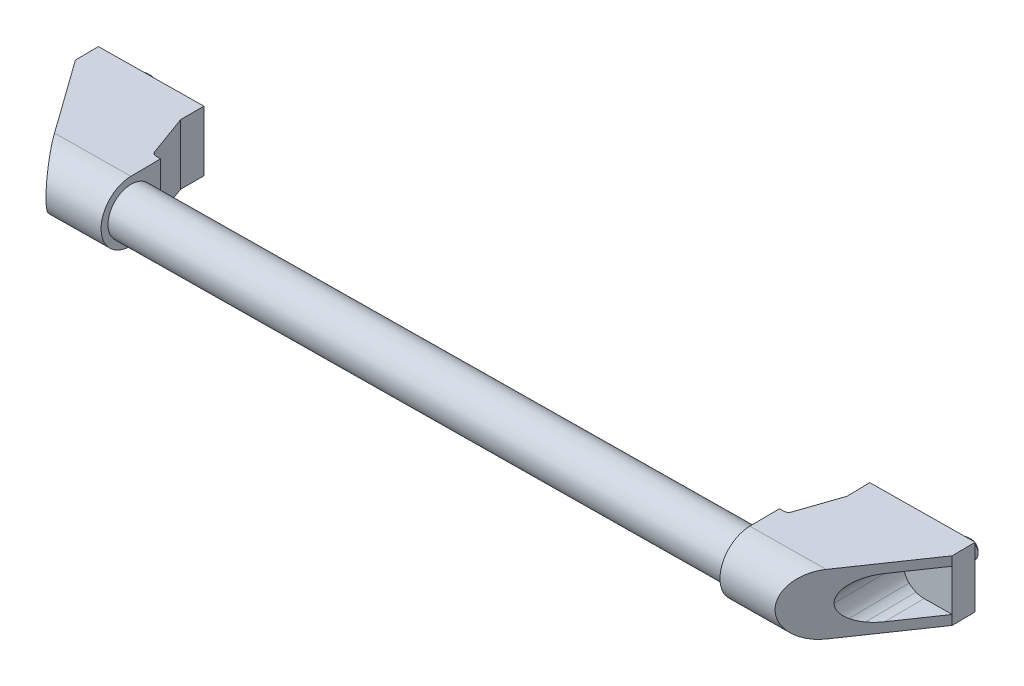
ISO-10303-21;
HEADER;
FILE_DESCRIPTION(('STEP AP214'),'2;1');
FILE_NAME('part.step','',(''),(''),'','','');
FILE_SCHEMA(('AUTOMOTIVE_DESIGN { 1 0 10303 214 1 1 1 1 }'));
ENDSEC;
DATA;
#1=APPLICATION_CONTEXT('core data for automotive mechanical design processes');
#2=APPLICATION_PROTOCOL_DEFINITION('international standard','automotive_design',2000,#1);
#3=PRODUCT_CONTEXT('',#1,'mechanical');
#4=PRODUCT('Part','Part','',(#3));
#5=PRODUCT_RELATED_PRODUCT_CATEGORY('part','',(#4));
#6=PRODUCT_DEFINITION_FORMATION('','',#4);
#7=PRODUCT_DEFINITION_CONTEXT('part definition',#1,'design');
#8=PRODUCT_DEFINITION('design','',#6,#7);
#9=PRODUCT_DEFINITION_SHAPE('','',#8);
#10=(LENGTH_UNIT() NAMED_UNIT(*) SI_UNIT(.MILLI.,.METRE.));
#11=(NAMED_UNIT(*) PLANE_ANGLE_UNIT() SI_UNIT($,.RADIAN.));
#12=(NAMED_UNIT(*) SI_UNIT($,.STERADIAN.) SOLID_ANGLE_UNIT());
#13=UNCERTAINTY_MEASURE_WITH_UNIT(LENGTH_MEASURE(1.E-05),#10,'distance_accuracy_value','');
#14=(GEOMETRIC_REPRESENTATION_CONTEXT(3) GLOBAL_UNCERTAINTY_ASSIGNED_CONTEXT((#13)) GLOBAL_UNIT_ASSIGNED_CONTEXT((#10,
#11,#12)) REPRESENTATION_CONTEXT('',''));
#15=CARTESIAN_POINT('',(0.,0.,0.));
#16=DIRECTION('',(0.,0.,1.));
#17=DIRECTION('',(1.,0.,0.));
#18=AXIS2_PLACEMENT_3D('',#15,#16,#17);
#19=CARTESIAN_POINT('',(361.980108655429,13.,-3.79485675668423));
#20=DIRECTION('',(-0.0104830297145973,0.,-0.999945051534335));
#21=DIRECTION('',(-0.999945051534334,0.,0.0104830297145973));
#22=AXIS2_PLACEMENT_3D('',#19,#20,#21);
#23=PLANE('',#22);
#24=DIRECTION('',(0.,-1.,0.));
#25=VECTOR('',#24,1.);
#26=CARTESIAN_POINT('',(336.98148236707,8.,-3.53278101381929));
#27=LINE('',#26,#25);
#28=CARTESIAN_POINT('',(336.98148236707,8.,-3.53278101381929));
#29=VERTEX_POINT('',#28);
#30=CARTESIAN_POINT('',(336.98148236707,-8.,-3.53278101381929));
#31=VERTEX_POINT('',#30);
#32=EDGE_CURVE('E497',#29,#31,#27,.T.);
#33=ORIENTED_EDGE('',*,*,#32,.F.);
#34=DIRECTION('',(-0.999945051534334,0.,0.0104830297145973));
#35=VECTOR('',#34,1.);
#36=CARTESIAN_POINT('',(336.98148236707,8.,-3.53278101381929));
#37=LINE('',#36,#35);
#38=CARTESIAN_POINT('',(321.982306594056,8.,-3.37553556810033));
#39=VERTEX_POINT('',#38);
#40=EDGE_CURVE('E30',#29,#39,#37,.T.);
#41=ORIENTED_EDGE('',*,*,#40,.T.);
#42=DIRECTION('',(0.,1.,0.));
#43=VECTOR('',#42,1.);
#44=CARTESIAN_POINT('',(321.982306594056,-8.,-3.37553556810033));
#45=LINE('',#44,#43);
#46=CARTESIAN_POINT('',(321.982306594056,-8.,-3.37553556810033));
#47=VERTEX_POINT('',#46);
#48=EDGE_CURVE('E491',#47,#39,#45,.T.);
#49=ORIENTED_EDGE('',*,*,#48,.F.);
#50=DIRECTION('',(0.999945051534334,0.,-0.0104830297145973));
#51=VECTOR('',#50,1.);
#52=CARTESIAN_POINT('',(321.982306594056,-8.,-3.37553556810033));
#53=LINE('',#52,#51);
#54=EDGE_CURVE('E494',#47,#31,#53,.T.);
#55=ORIENTED_EDGE('',*,*,#54,.T.);
#56=EDGE_LOOP('',(#33,#41,#49,#55));
#57=FACE_BOUND('',#56,.T.);
#58=DIRECTION('',(0.,1.,0.));
#59=VECTOR('',#58,1.);
#60=CARTESIAN_POINT('',(316.982581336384,-13.,-3.32312041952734));
#61=LINE('',#60,#59);
#62=CARTESIAN_POINT('',(316.982581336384,-13.,-3.32312041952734));
#63=VERTEX_POINT('',#62);
#64=CARTESIAN_POINT('',(316.982581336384,13.,-3.32312041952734));
#65=VERTEX_POINT('',#64);
#66=EDGE_CURVE('E595',#63,#65,#61,.T.);
#67=ORIENTED_EDGE('',*,*,#66,.T.);
#68=DIRECTION('',(-0.999945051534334,0.,0.0104830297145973));
#69=VECTOR('',#68,1.);
#70=CARTESIAN_POINT('',(361.980108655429,13.,-3.79485675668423));
#71=LINE('',#70,#69);
#72=CARTESIAN_POINT('',(361.980108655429,13.,-3.79485675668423));
#73=VERTEX_POINT('',#72);
#74=EDGE_CURVE('E626',#73,#65,#71,.T.);
#75=ORIENTED_EDGE('',*,*,#74,.F.);
#76=DIRECTION('',(0.,-1.,0.));
#77=VECTOR('',#76,1.);
#78=CARTESIAN_POINT('',(361.980108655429,13.,-3.79485675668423));
#79=LINE('',#78,#77);
#80=CARTESIAN_POINT('',(361.980108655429,-13.,-3.79485675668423));
#81=VERTEX_POINT('',#80);
#82=EDGE_CURVE('E621',#73,#81,#79,.T.);
#83=ORIENTED_EDGE('',*,*,#82,.T.);
#84=DIRECTION('',(-0.999945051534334,0.,0.0104830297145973));
#85=VECTOR('',#84,1.);
#86=CARTESIAN_POINT('',(361.980108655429,-13.,-3.79485675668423));
#87=LINE('',#86,#85);
#88=EDGE_CURVE('E629',#81,#63,#87,.T.);
#89=ORIENTED_EDGE('',*,*,#88,.T.);
#90=EDGE_LOOP('',(#67,#75,#83,#89));
#91=FACE_BOUND('',#90,.T.);
#92=CARTESIAN_POINT('',(349.980768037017,0.,-3.66906040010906));
#93=DIRECTION('',(0.0104830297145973,0.,0.999945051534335));
#94=DIRECTION('',(0.999945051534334,0.,-0.0104830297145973));
#95=AXIS2_PLACEMENT_3D('',#92,#93,#94);
#96=CIRCLE('',#95,4.);
#97=CARTESIAN_POINT('',(353.980548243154,0.,-3.71099251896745));
#98=VERTEX_POINT('',#97);
#99=EDGE_CURVE('E481',#98,#98,#96,.T.);
#100=ORIENTED_EDGE('',*,*,#99,.T.);
#101=EDGE_LOOP('',(#100));
#102=FACE_BOUND('',#101,.T.);
#103=ADVANCED_FACE('F14',(#57,#91,#102),#23,.T.);
#104=CARTESIAN_POINT('',(362.084938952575,-13.,6.20459375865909));
#105=DIRECTION('',(-0.825119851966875,0.,-0.564957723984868));
#106=DIRECTION('',(-0.564957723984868,0.,0.825119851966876));
#107=AXIS2_PLACEMENT_3D('',#104,#105,#106);
#108=PLANE('',#107);
#109=DIRECTION('',(0.564957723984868,0.,-0.825119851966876));
#110=VECTOR('',#109,1.);
#111=CARTESIAN_POINT('',(362.084938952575,-8.90119415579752,6.20459375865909));
#112=LINE('',#111,#110);
#113=CARTESIAN_POINT('',(350.265247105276,-8.90119415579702,23.4672347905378));
#114=VERTEX_POINT('',#113);
#115=CARTESIAN_POINT('',(362.084938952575,-8.90119415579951,6.20459375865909));
#116=VERTEX_POINT('',#115);
#117=EDGE_CURVE('E9',#114,#116,#112,.T.);
#118=ORIENTED_EDGE('',*,*,#117,.F.);
#119=CARTESIAN_POINT('',(350.265253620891,0.0988421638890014,23.467225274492));
#120=DIRECTION('',(-0.825119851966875,0.,-0.564957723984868));
#121=DIRECTION('',(-0.564957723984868,0.,0.825119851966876));
#122=AXIS2_PLACEMENT_3D('',#119,#120,#121);
#123=ELLIPSE('',#122,15.6910844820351,9.00003631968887);
#124=CARTESIAN_POINT('',(346.872848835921,-8.21611015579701,28.4218270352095));
#125=VERTEX_POINT('',#124);
#126=EDGE_CURVE('E23',#114,#125,#123,.T.);
#127=ORIENTED_EDGE('',*,*,#126,.T.);
#128=CARTESIAN_POINT('',(350.265267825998,0.0988360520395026,23.4672045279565));
#129=DIRECTION('',(-0.825119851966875,0.,-0.564957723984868));
#130=DIRECTION('',(-0.564957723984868,0.,0.825119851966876));
#131=AXIS2_PLACEMENT_3D('',#128,#129,#130);
#132=ELLIPSE('',#131,15.6910842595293,9.00003619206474);
#133=CARTESIAN_POINT('',(343.996912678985,-6.26515515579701,32.6221271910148));
#134=VERTEX_POINT('',#133);
#135=EDGE_CURVE('E651',#125,#134,#132,.T.);
#136=ORIENTED_EDGE('',*,*,#135,.T.);
#137=CARTESIAN_POINT('',(350.265286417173,0.0988180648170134,23.4671773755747));
#138=DIRECTION('',(-0.825119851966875,0.,-0.564957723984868));
#139=DIRECTION('',(-0.564957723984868,0.,0.825119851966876));
#140=AXIS2_PLACEMENT_3D('',#137,#138,#139);
#141=ELLIPSE('',#140,15.6910853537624,9.00003681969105);
#142=CARTESIAN_POINT('',(341.400486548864,0.0988089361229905,36.414203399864));
#143=VERTEX_POINT('',#142);
#144=EDGE_CURVE('E648',#134,#143,#141,.T.);
#145=ORIENTED_EDGE('',*,*,#144,.T.);
#146=CARTESIAN_POINT('',(350.265284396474,0.098790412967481,23.4671803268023));
#147=DIRECTION('',(-0.825119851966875,0.,-0.564957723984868));
#148=DIRECTION('',(-0.564957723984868,0.,0.825119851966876));
#149=AXIS2_PLACEMENT_3D('',#146,#147,#148);
#150=ELLIPSE('',#149,15.6910817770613,9.00003476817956);
#151=CARTESIAN_POINT('',(343.99691972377,6.4627699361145,32.6221169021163));
#152=VERTEX_POINT('',#151);
#153=EDGE_CURVE('E645',#143,#152,#150,.T.);
#154=ORIENTED_EDGE('',*,*,#153,.T.);
#155=CARTESIAN_POINT('',(350.265274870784,0.0987787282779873,23.4671942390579));
#156=DIRECTION('',(-0.825119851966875,0.,-0.564957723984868));
#157=DIRECTION('',(-0.564957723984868,0.,0.825119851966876));
#158=AXIS2_PLACEMENT_3D('',#155,#156,#157);
#159=ELLIPSE('',#158,15.6910842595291,9.00003619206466);
#160=CARTESIAN_POINT('',(346.872855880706,8.4137249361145,28.4218167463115));
#161=VERTEX_POINT('',#160);
#162=EDGE_CURVE('E642',#152,#161,#159,.T.);
#163=ORIENTED_EDGE('',*,*,#162,.T.);
#164=CARTESIAN_POINT('',(350.265260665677,0.098772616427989,23.4672149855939));
#165=DIRECTION('',(-0.825119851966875,0.,-0.564957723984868));
#166=DIRECTION('',(-0.564957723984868,0.,0.825119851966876));
#167=AXIS2_PLACEMENT_3D('',#164,#165,#166);
#168=ELLIPSE('',#167,15.691084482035,9.0000363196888);
#169=CARTESIAN_POINT('',(350.265254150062,9.09880893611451,23.4672245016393));
#170=VERTEX_POINT('',#169);
#171=EDGE_CURVE('E639',#161,#170,#168,.T.);
#172=ORIENTED_EDGE('',*,*,#171,.T.);
#173=DIRECTION('',(0.564957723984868,0.,-0.825119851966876));
#174=VECTOR('',#173,1.);
#175=CARTESIAN_POINT('',(362.084938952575,9.09880893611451,6.20459375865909));
#176=LINE('',#175,#174);
#177=CARTESIAN_POINT('',(362.084938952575,9.09880893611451,6.20459375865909));
#178=VERTEX_POINT('',#177);
#179=EDGE_CURVE('E636',#170,#178,#176,.T.);
#180=ORIENTED_EDGE('',*,*,#179,.T.);
#181=DIRECTION('',(0.,1.,0.));
#182=VECTOR('',#181,1.);
#183=CARTESIAN_POINT('',(362.084938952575,-13.,6.20459375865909));
#184=LINE('',#183,#182);
#185=CARTESIAN_POINT('',(362.084938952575,13.,6.20459375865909));
#186=VERTEX_POINT('',#185);
#187=EDGE_CURVE('E604',#178,#186,#184,.T.);
#188=ORIENTED_EDGE('',*,*,#187,.T.);
#189=DIRECTION('',(-0.564957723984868,0.,0.825119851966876));
#190=VECTOR('',#189,1.);
#191=CARTESIAN_POINT('',(362.084938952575,13.,6.20459375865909));
#192=LINE('',#191,#190);
#193=CARTESIAN_POINT('',(340.014985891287,13.,38.4377248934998));
#194=VERTEX_POINT('',#193);
#195=EDGE_CURVE('E598',#186,#194,#192,.T.);
#196=ORIENTED_EDGE('',*,*,#195,.T.);
#197=CARTESIAN_POINT('',(340.014985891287,0.,38.4377248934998));
#198=DIRECTION('',(-0.825119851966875,0.,-0.564957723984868));
#199=DIRECTION('',(-0.564957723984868,0.,0.825119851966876));
#200=AXIS2_PLACEMENT_3D('',#197,#198,#199);
#201=ELLIPSE('',#200,15.8700696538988,13.);
#202=CARTESIAN_POINT('',(340.014985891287,-13.,38.4377248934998));
#203=VERTEX_POINT('',#202);
#204=EDGE_CURVE('E608',#203,#194,#201,.T.);
#205=ORIENTED_EDGE('',*,*,#204,.F.);
#206=DIRECTION('',(-0.564957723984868,0.,0.825119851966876));
#207=VECTOR('',#206,1.);
#208=CARTESIAN_POINT('',(362.084938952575,-13.,6.20459375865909));
#209=LINE('',#208,#207);
#210=CARTESIAN_POINT('',(362.084938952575,-13.,6.20459375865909));
#211=VERTEX_POINT('',#210);
#212=EDGE_CURVE('E601',#211,#203,#209,.T.);
#213=ORIENTED_EDGE('',*,*,#212,.F.);
#214=EDGE_CURVE('E605',#211,#116,#184,.T.);
#215=ORIENTED_EDGE('',*,*,#214,.T.);
#216=EDGE_LOOP('',(#118,#127,#136,#145,#154,#163,#172,#180,#188,#196,#205,#213,#215));
#217=FACE_BOUND('',#216,.T.);
#218=ADVANCED_FACE('F657',(#217),#108,.F.);
#219=CARTESIAN_POINT('',(362.420395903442,13.,38.2028354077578));
#220=DIRECTION('',(0.,1.,0.));
#221=DIRECTION('',(-0.999945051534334,0.,0.0104830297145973));
#222=AXIS2_PLACEMENT_3D('',#219,#220,#221);
#223=PLANE('',#222);
#224=DIRECTION('',(-0.0209649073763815,0.,-0.999780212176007));
#225=VECTOR('',#224,1.);
#226=CARTESIAN_POINT('',(317.192230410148,13.,6.67468170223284));
#227=LINE('',#226,#225);
#228=CARTESIAN_POINT('',(317.192230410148,13.,6.67468170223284));
#229=VERTEX_POINT('',#228);
#230=EDGE_CURVE('E573',#229,#65,#227,.T.);
#231=ORIENTED_EDGE('',*,*,#230,.F.);
#232=DIRECTION('',(-0.322244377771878,0.,0.946656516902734));
#233=VECTOR('',#232,1.);
#234=CARTESIAN_POINT('',(317.192230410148,13.,6.67468170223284));
#235=LINE('',#234,#233);
#236=CARTESIAN_POINT('',(311.127925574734,13.,24.4897751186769));
#237=VERTEX_POINT('',#236);
#238=EDGE_CURVE('E570',#229,#237,#235,.T.);
#239=ORIENTED_EDGE('',*,*,#238,.T.);
#240=CARTESIAN_POINT('',(309.234612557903,13.,23.8452863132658));
#241=DIRECTION('',(0.,1.,0.));
#242=DIRECTION('',(-0.999945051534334,0.,0.0104830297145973));
#243=AXIS2_PLACEMENT_3D('',#240,#241,#242);
#244=CIRCLE('',#243,2.);
#245=CARTESIAN_POINT('',(309.276542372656,13.,25.8448467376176));
#246=VERTEX_POINT('',#245);
#247=EDGE_CURVE('E567',#246,#237,#244,.T.);
#248=ORIENTED_EDGE('',*,*,#247,.F.);
#249=DIRECTION('',(0.999780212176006,0.,-0.020964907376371));
#250=VECTOR('',#249,1.);
#251=CARTESIAN_POINT('',(307.288254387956,13.,25.8865401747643));
#252=LINE('',#251,#250);
#253=CARTESIAN_POINT('',(307.288254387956,13.,25.8865401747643));
#254=VERTEX_POINT('',#253);
#255=EDGE_CURVE('E564',#254,#246,#252,.T.);
#256=ORIENTED_EDGE('',*,*,#255,.F.);
#257=DIRECTION('',(-0.0104830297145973,0.,-0.999945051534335));
#258=VECTOR('',#257,1.);
#259=CARTESIAN_POINT('',(307.423418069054,13.,38.7794020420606));
#260=LINE('',#259,#258);
#261=CARTESIAN_POINT('',(307.423418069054,13.,38.7794020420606));
#262=VERTEX_POINT('',#261);
#263=EDGE_CURVE('E610',#262,#254,#260,.T.);
#264=ORIENTED_EDGE('',*,*,#263,.F.);
#265=DIRECTION('',(-0.999945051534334,0.,0.0104830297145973));
#266=VECTOR('',#265,1.);
#267=CARTESIAN_POINT('',(362.420395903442,13.,38.2028354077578));
#268=LINE('',#267,#266);
#269=EDGE_CURVE('E634',#194,#262,#268,.T.);
#270=ORIENTED_EDGE('',*,*,#269,.F.);
#271=ORIENTED_EDGE('',*,*,#195,.F.);
#272=DIRECTION('',(-0.0104830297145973,0.,-0.999945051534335));
#273=VECTOR('',#272,1.);
#274=CARTESIAN_POINT('',(362.420395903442,13.,38.2028354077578));
#275=LINE('',#274,#273);
#276=EDGE_CURVE('E619',#186,#73,#275,.T.);
#277=ORIENTED_EDGE('',*,*,#276,.T.);
#278=ORIENTED_EDGE('',*,*,#74,.T.);
#279=EDGE_LOOP('',(#231,#239,#248,#256,#264,#270,#271,#277,#278));
#280=FACE_BOUND('',#279,.T.);
#281=ADVANCED_FACE('F691',(#280),#223,.T.);
#282=CARTESIAN_POINT('',(362.420395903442,0.,38.2028354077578));
#283=DIRECTION('',(-0.999945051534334,0.,0.0104830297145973));
#284=DIRECTION('',(0.,-1.,0.));
#285=AXIS2_PLACEMENT_3D('',#282,#283,#284);
#286=CYLINDRICAL_SURFACE('',#285,13.);
#287=ORIENTED_EDGE('',*,*,#204,.T.);
#288=ORIENTED_EDGE('',*,*,#269,.T.);
#289=CARTESIAN_POINT('',(307.423418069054,0.,38.7794020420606));
#290=DIRECTION('',(0.999945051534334,0.,-0.0104830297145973));
#291=DIRECTION('',(0.,1.,0.));
#292=AXIS2_PLACEMENT_3D('',#289,#290,#291);
#293=CIRCLE('',#292,13.);
#294=CARTESIAN_POINT('',(307.423418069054,-13.,38.7794020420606));
#295=VERTEX_POINT('',#294);
#296=EDGE_CURVE('E616',#262,#295,#293,.T.);
#297=ORIENTED_EDGE('',*,*,#296,.T.);
#298=DIRECTION('',(-0.999945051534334,0.,0.0104830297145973));
#299=VECTOR('',#298,1.);
#300=CARTESIAN_POINT('',(362.420395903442,-13.,38.2028354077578));
#301=LINE('',#300,#299);
#302=EDGE_CURVE('E632',#203,#295,#301,.T.);
#303=ORIENTED_EDGE('',*,*,#302,.F.);
#304=EDGE_LOOP('',(#287,#288,#297,#303));
#305=FACE_BOUND('',#304,.T.);
#306=ADVANCED_FACE('F16',(#305),#286,.T.);
#307=CARTESIAN_POINT('',(362.420395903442,-13.,38.2028354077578));
#308=DIRECTION('',(0.,1.,0.));
#309=DIRECTION('',(-0.999945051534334,0.,0.0104830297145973));
#310=AXIS2_PLACEMENT_3D('',#307,#308,#309);
#311=PLANE('',#310);
#312=DIRECTION('',(-0.322244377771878,0.,0.946656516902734));
#313=VECTOR('',#312,1.);
#314=CARTESIAN_POINT('',(317.192230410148,-13.,6.67468170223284));
#315=LINE('',#314,#313);
#316=CARTESIAN_POINT('',(317.192230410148,-13.,6.67468170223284));
#317=VERTEX_POINT('',#316);
#318=CARTESIAN_POINT('',(311.127925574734,-13.,24.4897751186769));
#319=VERTEX_POINT('',#318);
#320=EDGE_CURVE('E581',#317,#319,#315,.T.);
#321=ORIENTED_EDGE('',*,*,#320,.F.);
#322=DIRECTION('',(-0.0209649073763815,0.,-0.999780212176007));
#323=VECTOR('',#322,1.);
#324=CARTESIAN_POINT('',(317.192230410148,-13.,6.67468170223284));
#325=LINE('',#324,#323);
#326=EDGE_CURVE('E584',#317,#63,#325,.T.);
#327=ORIENTED_EDGE('',*,*,#326,.T.);
#328=ORIENTED_EDGE('',*,*,#88,.F.);
#329=DIRECTION('',(-0.0104830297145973,0.,-0.999945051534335));
#330=VECTOR('',#329,1.);
#331=CARTESIAN_POINT('',(362.420395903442,-13.,38.2028354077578));
#332=LINE('',#331,#330);
#333=EDGE_CURVE('E624',#211,#81,#332,.T.);
#334=ORIENTED_EDGE('',*,*,#333,.F.);
#335=ORIENTED_EDGE('',*,*,#212,.T.);
#336=ORIENTED_EDGE('',*,*,#302,.T.);
#337=DIRECTION('',(-0.0104830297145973,0.,-0.999945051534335));
#338=VECTOR('',#337,1.);
#339=CARTESIAN_POINT('',(307.423418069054,-13.,38.7794020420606));
#340=LINE('',#339,#338);
#341=CARTESIAN_POINT('',(307.288254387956,-13.,25.8865401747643));
#342=VERTEX_POINT('',#341);
#343=EDGE_CURVE('E613',#295,#342,#340,.T.);
#344=ORIENTED_EDGE('',*,*,#343,.T.);
#345=DIRECTION('',(0.999780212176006,0.,-0.020964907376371));
#346=VECTOR('',#345,1.);
#347=CARTESIAN_POINT('',(307.288254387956,-13.,25.8865401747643));
#348=LINE('',#347,#346);
#349=CARTESIAN_POINT('',(309.276542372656,-13.,25.8448467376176));
#350=VERTEX_POINT('',#349);
#351=EDGE_CURVE('E575',#342,#350,#348,.T.);
#352=ORIENTED_EDGE('',*,*,#351,.T.);
#353=CARTESIAN_POINT('',(309.234612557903,-13.,23.8452863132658));
#354=DIRECTION('',(0.,1.,0.));
#355=DIRECTION('',(-0.999945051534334,0.,0.0104830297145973));
#356=AXIS2_PLACEMENT_3D('',#353,#354,#355);
#357=CIRCLE('',#356,2.);
#358=EDGE_CURVE('E578',#350,#319,#357,.T.);
#359=ORIENTED_EDGE('',*,*,#358,.T.);
#360=EDGE_LOOP('',(#321,#327,#328,#334,#335,#336,#344,#352,#359));
#361=FACE_BOUND('',#360,.T.);
#362=ADVANCED_FACE('F701',(#361),#311,.F.);
#363=CARTESIAN_POINT('',(362.420395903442,0.,38.2028354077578));
#364=DIRECTION('',(0.999945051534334,0.,-0.0104830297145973));
#365=DIRECTION('',(0.,1.,0.));
#366=AXIS2_PLACEMENT_3D('',#363,#364,#365);
#367=PLANE('',#366);
#368=ORIENTED_EDGE('',*,*,#214,.F.);
#369=ORIENTED_EDGE('',*,*,#333,.T.);
#370=ORIENTED_EDGE('',*,*,#82,.F.);
#371=ORIENTED_EDGE('',*,*,#276,.F.);
#372=ORIENTED_EDGE('',*,*,#187,.F.);
#373=DIRECTION('',(0.,1.,0.));
#374=VECTOR('',#373,1.);
#375=CARTESIAN_POINT('',(362.084938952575,-8.90119415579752,6.20459375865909));
#376=LINE('',#375,#374);
#377=EDGE_CURVE('E541',#116,#178,#376,.T.);
#378=ORIENTED_EDGE('',*,*,#377,.F.);
#379=EDGE_LOOP('',(#368,#369,#370,#371,#372,#378));
#380=FACE_BOUND('',#379,.T.);
#381=ADVANCED_FACE('F686',(#380),#367,.T.);
#382=CARTESIAN_POINT('',(307.423418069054,0.,38.7794020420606));
#383=DIRECTION('',(0.999945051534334,0.,-0.0104830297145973));
#384=DIRECTION('',(0.,1.,0.));
#385=AXIS2_PLACEMENT_3D('',#382,#383,#384);
#386=PLANE('',#385);
#387=CARTESIAN_POINT('',(307.423418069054,0.,38.7794020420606));
#388=DIRECTION('',(0.999945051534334,0.,-0.0104830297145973));
#389=DIRECTION('',(0.,1.,0.));
#390=AXIS2_PLACEMENT_3D('',#387,#388,#389);
#391=CIRCLE('',#390,10.);
#392=CARTESIAN_POINT('',(307.318587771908,0.,28.7799515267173));
#393=VERTEX_POINT('',#392);
#394=EDGE_CURVE('E18',#393,#393,#391,.T.);
#395=ORIENTED_EDGE('',*,*,#394,.T.);
#396=EDGE_LOOP('',(#395));
#397=FACE_BOUND('',#396,.T.);
#398=ORIENTED_EDGE('',*,*,#263,.T.);
#399=DIRECTION('',(0.,1.,0.));
#400=VECTOR('',#399,1.);
#401=CARTESIAN_POINT('',(307.288254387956,-13.,25.8865401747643));
#402=LINE('',#401,#400);
#403=EDGE_CURVE('E587',#342,#254,#402,.T.);
#404=ORIENTED_EDGE('',*,*,#403,.F.);
#405=ORIENTED_EDGE('',*,*,#343,.F.);
#406=ORIENTED_EDGE('',*,*,#296,.F.);
#407=EDGE_LOOP('',(#398,#404,#405,#406));
#408=FACE_BOUND('',#407,.T.);
#409=ADVANCED_FACE('F717',(#397,#408),#386,.F.);
#410=CARTESIAN_POINT('',(317.192230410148,-13.,6.67468170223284));
#411=DIRECTION('',(0.999780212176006,0.,-0.0209649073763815));
#412=DIRECTION('',(-0.0209649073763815,0.,-0.999780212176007));
#413=AXIS2_PLACEMENT_3D('',#410,#411,#412);
#414=PLANE('',#413);
#415=DIRECTION('',(0.,1.,0.));
#416=VECTOR('',#415,1.);
#417=CARTESIAN_POINT('',(317.192230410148,-13.,6.67468170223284));
#418=LINE('',#417,#416);
#419=EDGE_CURVE('E593',#317,#229,#418,.T.);
#420=ORIENTED_EDGE('',*,*,#419,.T.);
#421=ORIENTED_EDGE('',*,*,#230,.T.);
#422=ORIENTED_EDGE('',*,*,#66,.F.);
#423=ORIENTED_EDGE('',*,*,#326,.F.);
#424=EDGE_LOOP('',(#420,#421,#422,#423));
#425=FACE_BOUND('',#424,.T.);
#426=ADVANCED_FACE('F698',(#425),#414,.F.);
#427=CARTESIAN_POINT('',(317.192230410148,-13.,6.67468170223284));
#428=DIRECTION('',(-0.946656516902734,0.,-0.322244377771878));
#429=DIRECTION('',(-0.322244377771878,0.,0.946656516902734));
#430=AXIS2_PLACEMENT_3D('',#427,#428,#429);
#431=PLANE('',#430);
#432=DIRECTION('',(0.,1.,0.));
#433=VECTOR('',#432,1.);
#434=CARTESIAN_POINT('',(311.127925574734,-13.,24.4897751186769));
#435=LINE('',#434,#433);
#436=EDGE_CURVE('E591',#319,#237,#435,.T.);
#437=ORIENTED_EDGE('',*,*,#436,.T.);
#438=ORIENTED_EDGE('',*,*,#238,.F.);
#439=ORIENTED_EDGE('',*,*,#419,.F.);
#440=ORIENTED_EDGE('',*,*,#320,.T.);
#441=EDGE_LOOP('',(#437,#438,#439,#440));
#442=FACE_BOUND('',#441,.T.);
#443=ADVANCED_FACE('F705',(#442),#431,.T.);
#444=CARTESIAN_POINT('',(309.234612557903,-13.,23.8452863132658));
#445=DIRECTION('',(0.,1.,0.));
#446=DIRECTION('',(-0.999945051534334,0.,0.0104830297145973));
#447=AXIS2_PLACEMENT_3D('',#444,#445,#446);
#448=CYLINDRICAL_SURFACE('',#447,2.);
#449=DIRECTION('',(0.,1.,0.));
#450=VECTOR('',#449,1.);
#451=CARTESIAN_POINT('',(309.276542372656,-13.,25.8448467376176));
#452=LINE('',#451,#450);
#453=EDGE_CURVE('E589',#350,#246,#452,.T.);
#454=ORIENTED_EDGE('',*,*,#453,.T.);
#455=ORIENTED_EDGE('',*,*,#247,.T.);
#456=ORIENTED_EDGE('',*,*,#436,.F.);
#457=ORIENTED_EDGE('',*,*,#358,.F.);
#458=EDGE_LOOP('',(#454,#455,#456,#457));
#459=FACE_BOUND('',#458,.T.);
#460=ADVANCED_FACE('F711',(#459),#448,.F.);
#461=CARTESIAN_POINT('',(307.288254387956,-13.,25.8865401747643));
#462=DIRECTION('',(0.020964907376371,0.,0.999780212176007));
#463=DIRECTION('',(0.999780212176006,0.,-0.020964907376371));
#464=AXIS2_PLACEMENT_3D('',#461,#462,#463);
#465=PLANE('',#464);
#466=ORIENTED_EDGE('',*,*,#403,.T.);
#467=ORIENTED_EDGE('',*,*,#255,.T.);
#468=ORIENTED_EDGE('',*,*,#453,.F.);
#469=ORIENTED_EDGE('',*,*,#351,.F.);
#470=EDGE_LOOP('',(#466,#467,#468,#469));
#471=FACE_BOUND('',#470,.T.);
#472=ADVANCED_FACE('F713',(#471),#465,.F.);
#473=CARTESIAN_POINT('',(362.084938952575,-8.90119415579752,6.20459375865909));
#474=DIRECTION('',(0.,1.,0.));
#475=DIRECTION('',(-0.999945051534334,0.,0.0104830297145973));
#476=AXIS2_PLACEMENT_3D('',#473,#474,#475);
#477=PLANE('',#476);
#478=ORIENTED_EDGE('',*,*,#117,.T.);
#479=DIRECTION('',(-0.999945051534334,0.,0.0104830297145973));
#480=VECTOR('',#479,1.);
#481=CARTESIAN_POINT('',(362.084938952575,-8.90119415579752,6.20459375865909));
#482=LINE('',#481,#480);
#483=CARTESIAN_POINT('',(350.085591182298,-8.90119415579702,6.33039019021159));
#484=VERTEX_POINT('',#483);
#485=EDGE_CURVE('E38',#116,#484,#482,.T.);
#486=ORIENTED_EDGE('',*,*,#485,.T.);
#487=DIRECTION('',(0.0104830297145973,0.,0.999945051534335));
#488=VECTOR('',#487,1.);
#489=CARTESIAN_POINT('',(350.085591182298,-8.90119415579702,6.33039019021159));
#490=LINE('',#489,#488);
#491=EDGE_CURVE('E561',#484,#114,#490,.T.);
#492=ORIENTED_EDGE('',*,*,#491,.T.);
#493=EDGE_LOOP('',(#478,#486,#492));
#494=FACE_BOUND('',#493,.T.);
#495=ADVANCED_FACE('F662',(#494),#477,.T.);
#496=CARTESIAN_POINT('',(350.08559779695,0.0988421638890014,6.3303901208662));
#497=DIRECTION('',(0.0104830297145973,0.,0.999945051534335));
#498=DIRECTION('',(0.999945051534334,0.,-0.0104830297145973));
#499=AXIS2_PLACEMENT_3D('',#496,#497,#498);
#500=CYLINDRICAL_SURFACE('',#499,9.00003631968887);
#501=ORIENTED_EDGE('',*,*,#491,.F.);
#502=CARTESIAN_POINT('',(350.08559779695,0.0988421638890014,6.3303901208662));
#503=DIRECTION('',(0.0104830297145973,0.,0.999945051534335));
#504=DIRECTION('',(0.999945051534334,0.,-0.0104830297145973));
#505=AXIS2_PLACEMENT_3D('',#502,#503,#504);
#506=CIRCLE('',#505,9.00003631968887);
#507=CARTESIAN_POINT('',(346.641629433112,-8.21611015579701,6.36649532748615));
#508=VERTEX_POINT('',#507);
#509=EDGE_CURVE('E521',#508,#484,#506,.T.);
#510=ORIENTED_EDGE('',*,*,#509,.F.);
#511=DIRECTION('',(0.0104830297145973,0.,0.999945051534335));
#512=VECTOR('',#511,1.);
#513=CARTESIAN_POINT('',(346.641629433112,-8.21611015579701,6.36649532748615));
#514=LINE('',#513,#512);
#515=EDGE_CURVE('E558',#508,#125,#514,.T.);
#516=ORIENTED_EDGE('',*,*,#515,.T.);
#517=ORIENTED_EDGE('',*,*,#126,.F.);
#518=EDGE_LOOP('',(#501,#510,#516,#517));
#519=FACE_BOUND('',#518,.T.);
#520=ADVANCED_FACE('F659',(#519),#500,.F.);
#521=CARTESIAN_POINT('',(350.085612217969,0.0988360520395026,6.33038996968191));
#522=DIRECTION('',(0.0104830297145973,0.,0.999945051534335));
#523=DIRECTION('',(0.999945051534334,0.,-0.0104830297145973));
#524=AXIS2_PLACEMENT_3D('',#521,#522,#523);
#525=CYLINDRICAL_SURFACE('',#524,9.00003619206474);
#526=ORIENTED_EDGE('',*,*,#515,.F.);
#527=CARTESIAN_POINT('',(350.085612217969,0.0988360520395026,6.33038996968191));
#528=DIRECTION('',(0.0104830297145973,0.,0.999945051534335));
#529=DIRECTION('',(0.999945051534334,0.,-0.0104830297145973));
#530=AXIS2_PLACEMENT_3D('',#527,#528,#529);
#531=CIRCLE('',#530,9.00003619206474);
#532=CARTESIAN_POINT('',(343.721979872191,-6.26515515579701,6.39710378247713));
#533=VERTEX_POINT('',#532);
#534=EDGE_CURVE('E523',#533,#508,#531,.T.);
#535=ORIENTED_EDGE('',*,*,#534,.F.);
#536=DIRECTION('',(0.0104830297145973,0.,0.999945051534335));
#537=VECTOR('',#536,1.);
#538=CARTESIAN_POINT('',(343.721979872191,-6.26515515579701,6.39710378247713));
#539=LINE('',#538,#537);
#540=EDGE_CURVE('E555',#533,#134,#539,.T.);
#541=ORIENTED_EDGE('',*,*,#540,.T.);
#542=ORIENTED_EDGE('',*,*,#135,.F.);
#543=EDGE_LOOP('',(#526,#535,#541,#542));
#544=FACE_BOUND('',#543,.T.);
#545=ADVANCED_FACE('F667',(#544),#525,.F.);
#546=CARTESIAN_POINT('',(350.085631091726,0.0988180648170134,6.33038977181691));
#547=DIRECTION('',(0.0104830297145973,0.,0.999945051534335));
#548=DIRECTION('',(0.999945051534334,0.,-0.0104830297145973));
#549=AXIS2_PLACEMENT_3D('',#546,#547,#548);
#550=CYLINDRICAL_SURFACE('',#549,9.00003681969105);
#551=ORIENTED_EDGE('',*,*,#540,.F.);
#552=CARTESIAN_POINT('',(350.085631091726,0.0988180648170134,6.33038977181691));
#553=DIRECTION('',(0.0104830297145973,0.,0.999945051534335));
#554=DIRECTION('',(0.999945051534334,0.,-0.0104830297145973));
#555=AXIS2_PLACEMENT_3D('',#552,#553,#554);
#556=CIRCLE('',#555,9.00003681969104);
#557=CARTESIAN_POINT('',(341.086088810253,0.0988089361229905,6.42473742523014));
#558=VERTEX_POINT('',#557);
#559=EDGE_CURVE('E526',#558,#533,#556,.T.);
#560=ORIENTED_EDGE('',*,*,#559,.F.);
#561=DIRECTION('',(0.0104830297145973,0.,0.999945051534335));
#562=VECTOR('',#561,1.);
#563=CARTESIAN_POINT('',(341.086088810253,0.0988089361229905,6.42473742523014));
#564=LINE('',#563,#562);
#565=EDGE_CURVE('E552',#558,#143,#564,.T.);
#566=ORIENTED_EDGE('',*,*,#565,.T.);
#567=ORIENTED_EDGE('',*,*,#144,.F.);
#568=EDGE_LOOP('',(#551,#560,#566,#567));
#569=FACE_BOUND('',#568,.T.);
#570=ADVANCED_FACE('F669',(#569),#550,.F.);
#571=CARTESIAN_POINT('',(350.085629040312,0.098790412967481,6.33038979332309));
#572=DIRECTION('',(0.0104830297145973,0.,0.999945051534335));
#573=DIRECTION('',(0.999945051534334,0.,-0.0104830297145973));
#574=AXIS2_PLACEMENT_3D('',#571,#572,#573);
#575=CYLINDRICAL_SURFACE('',#574,9.00003476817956);
#576=ORIENTED_EDGE('',*,*,#565,.F.);
#577=CARTESIAN_POINT('',(350.085629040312,0.098790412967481,6.33038979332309));
#578=DIRECTION('',(0.0104830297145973,0.,0.999945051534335));
#579=DIRECTION('',(0.999945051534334,0.,-0.0104830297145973));
#580=AXIS2_PLACEMENT_3D('',#577,#578,#579);
#581=CIRCLE('',#580,9.00003476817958);
#582=CARTESIAN_POINT('',(343.721987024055,6.4627699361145,6.3971037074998));
#583=VERTEX_POINT('',#582);
#584=EDGE_CURVE('E529',#583,#558,#581,.T.);
#585=ORIENTED_EDGE('',*,*,#584,.F.);
#586=DIRECTION('',(0.0104830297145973,0.,0.999945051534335));
#587=VECTOR('',#586,1.);
#588=CARTESIAN_POINT('',(343.721987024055,6.4627699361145,6.3971037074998));
#589=LINE('',#588,#587);
#590=EDGE_CURVE('E549',#583,#152,#589,.T.);
#591=ORIENTED_EDGE('',*,*,#590,.T.);
#592=ORIENTED_EDGE('',*,*,#153,.F.);
#593=EDGE_LOOP('',(#576,#585,#591,#592));
#594=FACE_BOUND('',#593,.T.);
#595=ADVANCED_FACE('F672',(#594),#575,.F.);
#596=CARTESIAN_POINT('',(350.085619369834,0.0987787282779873,6.33038989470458));
#597=DIRECTION('',(0.0104830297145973,0.,0.999945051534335));
#598=DIRECTION('',(0.999945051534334,0.,-0.0104830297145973));
#599=AXIS2_PLACEMENT_3D('',#596,#597,#598);
#600=CYLINDRICAL_SURFACE('',#599,9.00003619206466);
#601=ORIENTED_EDGE('',*,*,#590,.F.);
#602=CARTESIAN_POINT('',(350.085619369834,0.0987787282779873,6.33038989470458));
#603=DIRECTION('',(0.0104830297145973,0.,0.999945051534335));
#604=DIRECTION('',(0.999945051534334,0.,-0.0104830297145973));
#605=AXIS2_PLACEMENT_3D('',#602,#603,#604);
#606=CIRCLE('',#605,9.00003619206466);
#607=CARTESIAN_POINT('',(346.641636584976,8.4137249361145,6.36649525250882));
#608=VERTEX_POINT('',#607);
#609=EDGE_CURVE('E532',#608,#583,#606,.T.);
#610=ORIENTED_EDGE('',*,*,#609,.F.);
#611=DIRECTION('',(0.0104830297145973,0.,0.999945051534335));
#612=VECTOR('',#611,1.);
#613=CARTESIAN_POINT('',(346.641636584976,8.4137249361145,6.36649525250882));
#614=LINE('',#613,#612);
#615=EDGE_CURVE('E546',#608,#161,#614,.T.);
#616=ORIENTED_EDGE('',*,*,#615,.T.);
#617=ORIENTED_EDGE('',*,*,#162,.F.);
#618=EDGE_LOOP('',(#601,#610,#616,#617));
#619=FACE_BOUND('',#618,.T.);
#620=ADVANCED_FACE('F676',(#619),#600,.F.);
#621=CARTESIAN_POINT('',(350.085604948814,0.098772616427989,6.33039004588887));
#622=DIRECTION('',(0.0104830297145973,0.,0.999945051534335));
#623=DIRECTION('',(0.999945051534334,0.,-0.0104830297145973));
#624=AXIS2_PLACEMENT_3D('',#621,#622,#623);
#625=CYLINDRICAL_SURFACE('',#624,9.0000363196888);
#626=ORIENTED_EDGE('',*,*,#615,.F.);
#627=CARTESIAN_POINT('',(350.085604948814,0.098772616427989,6.33039004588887));
#628=DIRECTION('',(0.0104830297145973,0.,0.999945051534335));
#629=DIRECTION('',(0.999945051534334,0.,-0.0104830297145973));
#630=AXIS2_PLACEMENT_3D('',#627,#628,#629);
#631=CIRCLE('',#630,9.0000363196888);
#632=CARTESIAN_POINT('',(350.085598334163,9.09880893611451,6.33039011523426));
#633=VERTEX_POINT('',#632);
#634=EDGE_CURVE('E535',#633,#608,#631,.T.);
#635=ORIENTED_EDGE('',*,*,#634,.F.);
#636=DIRECTION('',(0.0104830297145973,0.,0.999945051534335));
#637=VECTOR('',#636,1.);
#638=CARTESIAN_POINT('',(350.085598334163,9.09880893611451,6.33039011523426));
#639=LINE('',#638,#637);
#640=EDGE_CURVE('E543',#633,#170,#639,.T.);
#641=ORIENTED_EDGE('',*,*,#640,.T.);
#642=ORIENTED_EDGE('',*,*,#171,.F.);
#643=EDGE_LOOP('',(#626,#635,#641,#642));
#644=FACE_BOUND('',#643,.T.);
#645=ADVANCED_FACE('F679',(#644),#625,.F.);
#646=CARTESIAN_POINT('',(362.084938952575,9.09880893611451,6.20459375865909));
#647=DIRECTION('',(0.,1.,0.));
#648=DIRECTION('',(-0.999945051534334,0.,0.0104830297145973));
#649=AXIS2_PLACEMENT_3D('',#646,#647,#648);
#650=PLANE('',#649);
#651=ORIENTED_EDGE('',*,*,#640,.F.);
#652=DIRECTION('',(-0.999945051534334,0.,0.0104830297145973));
#653=VECTOR('',#652,1.);
#654=CARTESIAN_POINT('',(362.084938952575,9.09880893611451,6.20459375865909));
#655=LINE('',#654,#653);
#656=EDGE_CURVE('E538',#178,#633,#655,.T.);
#657=ORIENTED_EDGE('',*,*,#656,.F.);
#658=ORIENTED_EDGE('',*,*,#179,.F.);
#659=EDGE_LOOP('',(#651,#657,#658));
#660=FACE_BOUND('',#659,.T.);
#661=ADVANCED_FACE('F764',(#660),#650,.F.);
#662=CARTESIAN_POINT('',(350.08559779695,0.0988421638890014,6.3303901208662));
#663=DIRECTION('',(0.0104830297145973,0.,0.999945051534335));
#664=DIRECTION('',(0.999945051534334,0.,-0.0104830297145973));
#665=AXIS2_PLACEMENT_3D('',#662,#663,#664);
#666=PLANE('',#665);
#667=ORIENTED_EDGE('',*,*,#485,.F.);
#668=ORIENTED_EDGE('',*,*,#377,.T.);
#669=ORIENTED_EDGE('',*,*,#656,.T.);
#670=ORIENTED_EDGE('',*,*,#634,.T.);
#671=ORIENTED_EDGE('',*,*,#609,.T.);
#672=ORIENTED_EDGE('',*,*,#584,.T.);
#673=ORIENTED_EDGE('',*,*,#559,.T.);
#674=ORIENTED_EDGE('',*,*,#534,.T.);
#675=ORIENTED_EDGE('',*,*,#509,.T.);
#676=EDGE_LOOP('',(#667,#668,#669,#670,#671,#672,#673,#674,#675));
#677=FACE_BOUND('',#676,.T.);
#678=ADVANCED_FACE('F664',(#677),#666,.T.);
#679=CARTESIAN_POINT('',(337.295973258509,8.,26.4655705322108));
#680=DIRECTION('',(0.,-1.,0.));
#681=DIRECTION('',(0.999945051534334,0.,-0.0104830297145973));
#682=AXIS2_PLACEMENT_3D('',#679,#680,#681);
#683=PLANE('',#682);
#684=DIRECTION('',(-0.0104830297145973,0.,-0.999945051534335));
#685=VECTOR('',#684,1.);
#686=CARTESIAN_POINT('',(322.296797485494,8.,26.6228159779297));
#687=LINE('',#686,#685);
#688=CARTESIAN_POINT('',(322.296797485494,8.,26.6228159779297));
#689=VERTEX_POINT('',#688);
#690=EDGE_CURVE('E518',#689,#39,#687,.T.);
#691=ORIENTED_EDGE('',*,*,#690,.T.);
#692=ORIENTED_EDGE('',*,*,#40,.F.);
#693=DIRECTION('',(-0.0104830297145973,0.,-0.999945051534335));
#694=VECTOR('',#693,1.);
#695=CARTESIAN_POINT('',(337.295973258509,8.,26.4655705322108));
#696=LINE('',#695,#694);
#697=CARTESIAN_POINT('',(337.295973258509,8.,26.4655705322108));
#698=VERTEX_POINT('',#697);
#699=EDGE_CURVE('E512',#698,#29,#696,.T.);
#700=ORIENTED_EDGE('',*,*,#699,.F.);
#701=DIRECTION('',(-0.999945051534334,0.,0.0104830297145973));
#702=VECTOR('',#701,1.);
#703=CARTESIAN_POINT('',(337.295973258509,8.,26.4655705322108));
#704=LINE('',#703,#702);
#705=EDGE_CURVE('E500',#698,#689,#704,.T.);
#706=ORIENTED_EDGE('',*,*,#705,.T.);
#707=EDGE_LOOP('',(#691,#692,#700,#706));
#708=FACE_BOUND('',#707,.T.);
#709=ADVANCED_FACE('F771',(#708),#683,.T.);
#710=CARTESIAN_POINT('',(322.296797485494,-8.,26.6228159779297));
#711=DIRECTION('',(-0.999945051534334,0.,0.0104830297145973));
#712=DIRECTION('',(0.,-1.,0.));
#713=AXIS2_PLACEMENT_3D('',#710,#711,#712);
#714=PLANE('',#713);
#715=DIRECTION('',(-0.0104830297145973,0.,-0.999945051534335));
#716=VECTOR('',#715,1.);
#717=CARTESIAN_POINT('',(322.296797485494,-8.,26.6228159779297));
#718=LINE('',#717,#716);
#719=CARTESIAN_POINT('',(322.296797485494,-8.,26.6228159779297));
#720=VERTEX_POINT('',#719);
#721=EDGE_CURVE('E516',#720,#47,#718,.T.);
#722=ORIENTED_EDGE('',*,*,#721,.T.);
#723=ORIENTED_EDGE('',*,*,#48,.T.);
#724=ORIENTED_EDGE('',*,*,#690,.F.);
#725=DIRECTION('',(0.,1.,0.));
#726=VECTOR('',#725,1.);
#727=CARTESIAN_POINT('',(322.296797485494,-8.,26.6228159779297));
#728=LINE('',#727,#726);
#729=EDGE_CURVE('E503',#720,#689,#728,.T.);
#730=ORIENTED_EDGE('',*,*,#729,.F.);
#731=EDGE_LOOP('',(#722,#723,#724,#730));
#732=FACE_BOUND('',#731,.T.);
#733=ADVANCED_FACE('F772',(#732),#714,.F.);
#734=CARTESIAN_POINT('',(322.296797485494,-8.,26.6228159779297));
#735=DIRECTION('',(0.,1.,0.));
#736=DIRECTION('',(-0.999945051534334,0.,0.0104830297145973));
#737=AXIS2_PLACEMENT_3D('',#734,#735,#736);
#738=PLANE('',#737);
#739=DIRECTION('',(-0.0104830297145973,0.,-0.999945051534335));
#740=VECTOR('',#739,1.);
#741=CARTESIAN_POINT('',(337.295973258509,-8.,26.4655705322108));
#742=LINE('',#741,#740);
#743=CARTESIAN_POINT('',(337.295973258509,-8.,26.4655705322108));
#744=VERTEX_POINT('',#743);
#745=EDGE_CURVE('E514',#744,#31,#742,.T.);
#746=ORIENTED_EDGE('',*,*,#745,.T.);
#747=ORIENTED_EDGE('',*,*,#54,.F.);
#748=ORIENTED_EDGE('',*,*,#721,.F.);
#749=DIRECTION('',(0.999945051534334,0.,-0.0104830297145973));
#750=VECTOR('',#749,1.);
#751=CARTESIAN_POINT('',(322.296797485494,-8.,26.6228159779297));
#752=LINE('',#751,#750);
#753=EDGE_CURVE('E506',#720,#744,#752,.T.);
#754=ORIENTED_EDGE('',*,*,#753,.T.);
#755=EDGE_LOOP('',(#746,#747,#748,#754));
#756=FACE_BOUND('',#755,.T.);
#757=ADVANCED_FACE('F775',(#756),#738,.T.);
#758=CARTESIAN_POINT('',(337.295973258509,8.,26.4655705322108));
#759=DIRECTION('',(0.999945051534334,0.,-0.0104830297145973));
#760=DIRECTION('',(0.,1.,0.));
#761=AXIS2_PLACEMENT_3D('',#758,#759,#760);
#762=PLANE('',#761);
#763=DIRECTION('',(0.,-1.,0.));
#764=VECTOR('',#763,1.);
#765=CARTESIAN_POINT('',(337.295973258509,8.,26.4655705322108));
#766=LINE('',#765,#764);
#767=EDGE_CURVE('E509',#698,#744,#766,.T.);
#768=ORIENTED_EDGE('',*,*,#767,.F.);
#769=ORIENTED_EDGE('',*,*,#699,.T.);
#770=ORIENTED_EDGE('',*,*,#32,.T.);
#771=ORIENTED_EDGE('',*,*,#745,.F.);
#772=EDGE_LOOP('',(#768,#769,#770,#771));
#773=FACE_BOUND('',#772,.T.);
#774=ADVANCED_FACE('F779',(#773),#762,.F.);
#775=CARTESIAN_POINT('',(322.296797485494,8.,26.6228159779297));
#776=DIRECTION('',(-0.0104830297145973,0.,-0.999945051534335));
#777=DIRECTION('',(-0.999945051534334,0.,0.0104830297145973));
#778=AXIS2_PLACEMENT_3D('',#775,#776,#777);
#779=PLANE('',#778);
#780=ORIENTED_EDGE('',*,*,#705,.F.);
#781=ORIENTED_EDGE('',*,*,#767,.T.);
#782=ORIENTED_EDGE('',*,*,#753,.F.);
#783=ORIENTED_EDGE('',*,*,#729,.T.);
#784=EDGE_LOOP('',(#780,#781,#782,#783));
#785=FACE_BOUND('',#784,.T.);
#786=ADVANCED_FACE('F781',(#785),#779,.T.);
#787=CARTESIAN_POINT('',(349.869647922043,0.,-14.268477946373));
#788=DIRECTION('',(0.0104830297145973,0.,0.999945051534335));
#789=DIRECTION('',(0.999945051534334,0.,-0.0104830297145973));
#790=AXIS2_PLACEMENT_3D('',#787,#788,#789);
#791=PLANE('',#790);
#792=CARTESIAN_POINT('',(349.869647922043,0.,-14.268477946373));
#793=DIRECTION('',(0.0104830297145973,0.,0.999945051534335));
#794=DIRECTION('',(0.999945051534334,0.,-0.0104830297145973));
#795=AXIS2_PLACEMENT_3D('',#792,#793,#794);
#796=CIRCLE('',#795,2.8);
#797=CARTESIAN_POINT('',(352.669494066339,0.,-14.2978304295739));
#798=VERTEX_POINT('',#797);
#799=EDGE_CURVE('E487',#798,#798,#796,.T.);
#800=ORIENTED_EDGE('',*,*,#799,.F.);
#801=EDGE_LOOP('',(#800));
#802=FACE_BOUND('',#801,.T.);
#803=ADVANCED_FACE('F785',(#802),#791,.F.);
#804=CARTESIAN_POINT('',(349.869647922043,0.,-14.268477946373));
#805=DIRECTION('',(0.0104830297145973,0.,0.999945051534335));
#806=DIRECTION('',(0.999945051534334,0.,-0.0104830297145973));
#807=AXIS2_PLACEMENT_3D('',#804,#805,#806);
#808=CONICAL_SURFACE('',#807,2.8,0.785398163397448);
#809=CARTESIAN_POINT('',(349.8822275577,0.,-13.0685438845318));
#810=DIRECTION('',(0.0104830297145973,0.,0.999945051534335));
#811=DIRECTION('',(0.999945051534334,0.,-0.0104830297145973));
#812=AXIS2_PLACEMENT_3D('',#809,#810,#811);
#813=CIRCLE('',#812,4.);
#814=CARTESIAN_POINT('',(353.882007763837,0.,-13.1104760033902));
#815=VERTEX_POINT('',#814);
#816=EDGE_CURVE('E484',#815,#815,#813,.T.);
#817=ORIENTED_EDGE('',*,*,#816,.F.);
#818=EDGE_LOOP('',(#817));
#819=FACE_BOUND('',#818,.T.);
#820=ORIENTED_EDGE('',*,*,#799,.T.);
#821=EDGE_LOOP('',(#820));
#822=FACE_BOUND('',#821,.T.);
#823=ADVANCED_FACE('F793',(#819,#822),#808,.T.);
#824=CARTESIAN_POINT('',(350.265254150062,0.,23.4672245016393));
#825=DIRECTION('',(0.0104830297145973,0.,0.999945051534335));
#826=DIRECTION('',(0.999945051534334,0.,-0.0104830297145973));
#827=AXIS2_PLACEMENT_3D('',#824,#825,#826);
#828=CYLINDRICAL_SURFACE('',#827,4.);
#829=ORIENTED_EDGE('',*,*,#816,.T.);
#830=EDGE_LOOP('',(#829));
#831=FACE_BOUND('',#830,.T.);
#832=ORIENTED_EDGE('',*,*,#99,.F.);
#833=EDGE_LOOP('',(#832));
#834=FACE_BOUND('',#833,.T.);
#835=ADVANCED_FACE('F797',(#831,#834),#828,.T.);
#836=CARTESIAN_POINT('',(346.977086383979,0.,38.3647369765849));
#837=DIRECTION('',(0.999945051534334,0.,-0.0104830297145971));
#838=DIRECTION('',(-0.0104830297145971,0.,-0.999945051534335));
#839=AXIS2_PLACEMENT_3D('',#836,#837,#838);
#840=CYLINDRICAL_SURFACE('',#839,10.);
#841=CARTESIAN_POINT('',(43.4379244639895,0.,41.5469218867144));
#842=DIRECTION('',(0.999945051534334,0.,-0.0104830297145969));
#843=DIRECTION('',(0.,1.,0.));
#844=AXIS2_PLACEMENT_3D('',#841,#842,#843);
#845=CIRCLE('',#844,10.);
#846=CARTESIAN_POINT('',(43.3330941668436,0.,31.5474713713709));
#847=VERTEX_POINT('',#846);
#848=EDGE_CURVE('E477',#847,#847,#845,.T.);
#849=CARTESIAN_POINT('',(307.318587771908,0.,28.7799515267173));
#850=CARTESIAN_POINT('',(304.568738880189,0.,28.8087798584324));
#851=CARTESIAN_POINT('',(301.818889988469,0.,28.8376081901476));
#852=CARTESIAN_POINT('',(296.31919220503,0.,28.8952648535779));
#853=CARTESIAN_POINT('',(293.569343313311,0.,28.924093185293));
#854=CARTESIAN_POINT('',(288.069645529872,0.,28.9817498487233));
#855=CARTESIAN_POINT('',(285.319796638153,0.,29.0105781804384));
#856=CARTESIAN_POINT('',(279.820098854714,0.,29.0682348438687));
#857=CARTESIAN_POINT('',(277.070249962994,0.,29.0970631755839));
#858=CARTESIAN_POINT('',(271.570552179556,0.,29.1547198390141));
#859=CARTESIAN_POINT('',(268.820703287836,0.,29.1835481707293));
#860=CARTESIAN_POINT('',(263.321005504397,0.,29.2412048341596));
#861=CARTESIAN_POINT('',(260.571156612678,0.,29.2700331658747));
#862=CARTESIAN_POINT('',(255.071458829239,0.,29.327689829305));
#863=CARTESIAN_POINT('',(252.32160993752,0.,29.3565181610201));
#864=CARTESIAN_POINT('',(246.821912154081,0.,29.4141748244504));
#865=CARTESIAN_POINT('',(244.072063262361,0.,29.4430031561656));
#866=CARTESIAN_POINT('',(238.572365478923,0.,29.5006598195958));
#867=CARTESIAN_POINT('',(235.822516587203,0.,29.529488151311));
#868=CARTESIAN_POINT('',(230.322818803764,0.,29.5871448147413));
#869=CARTESIAN_POINT('',(227.572969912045,0.,29.6159731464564));
#870=CARTESIAN_POINT('',(222.073272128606,0.,29.6736298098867));
#871=CARTESIAN_POINT('',(219.323423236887,0.,29.7024581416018));
#872=CARTESIAN_POINT('',(213.823725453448,0.,29.7601148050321));
#873=CARTESIAN_POINT('',(211.073876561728,0.,29.7889431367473));
#874=CARTESIAN_POINT('',(205.574178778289,0.,29.8465998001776));
#875=CARTESIAN_POINT('',(202.82432988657,0.,29.8754281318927));
#876=CARTESIAN_POINT('',(197.324632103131,0.,29.933084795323));
#877=CARTESIAN_POINT('',(194.574783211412,0.,29.9619131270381));
#878=CARTESIAN_POINT('',(189.075085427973,0.,30.0195697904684));
#879=CARTESIAN_POINT('',(186.325236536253,0.,30.0483981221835));
#880=CARTESIAN_POINT('',(180.825538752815,0.,30.1060547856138));
#881=CARTESIAN_POINT('',(178.075689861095,0.,30.134883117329));
#882=CARTESIAN_POINT('',(172.575992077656,0.,30.1925397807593));
#883=CARTESIAN_POINT('',(169.826143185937,0.,30.2213681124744));
#884=CARTESIAN_POINT('',(164.326445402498,0.,30.2790247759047));
#885=CARTESIAN_POINT('',(161.576596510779,0.,30.3078531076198));
#886=CARTESIAN_POINT('',(156.07689872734,0.,30.3655097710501));
#887=CARTESIAN_POINT('',(153.32704983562,0.,30.3943381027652));
#888=CARTESIAN_POINT('',(147.827352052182,0.,30.4519947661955));
#889=CARTESIAN_POINT('',(145.077503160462,0.,30.4808230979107));
#890=CARTESIAN_POINT('',(139.577805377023,0.,30.538479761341));
#891=CARTESIAN_POINT('',(136.827956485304,0.,30.5673080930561));
#892=CARTESIAN_POINT('',(131.328258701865,0.,30.6249647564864));
#893=CARTESIAN_POINT('',(128.578409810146,0.,30.6537930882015));
#894=CARTESIAN_POINT('',(123.078712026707,0.,30.7114497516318));
#895=CARTESIAN_POINT('',(120.328863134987,0.,30.740278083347));
#896=CARTESIAN_POINT('',(114.829165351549,0.,30.7979347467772));
#897=CARTESIAN_POINT('',(112.079316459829,0.,30.8267630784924));
#898=CARTESIAN_POINT('',(106.57961867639,0.,30.8844197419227));
#899=CARTESIAN_POINT('',(103.829769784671,0.,30.9132480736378));
#900=CARTESIAN_POINT('',(98.330072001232,0.,30.9709047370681));
#901=CARTESIAN_POINT('',(95.5802231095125,0.,30.9997330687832));
#902=CARTESIAN_POINT('',(90.0805253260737,0.,31.0573897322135));
#903=CARTESIAN_POINT('',(87.3306764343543,0.,31.0862180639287));
#904=CARTESIAN_POINT('',(81.8309786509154,0.,31.1438747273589));
#905=CARTESIAN_POINT('',(79.081129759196,0.,31.1727030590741));
#906=CARTESIAN_POINT('',(73.5814319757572,0.,31.2303597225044));
#907=CARTESIAN_POINT('',(70.8315830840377,0.,31.2591880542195));
#908=CARTESIAN_POINT('',(65.3318853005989,0.,31.3168447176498));
#909=CARTESIAN_POINT('',(62.5820364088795,0.,31.3456730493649));
#910=CARTESIAN_POINT('',(57.0823386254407,0.,31.4033297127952));
#911=CARTESIAN_POINT('',(54.3324897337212,0.,31.4321580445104));
#912=CARTESIAN_POINT('',(48.8327919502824,0.,31.4898147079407));
#913=CARTESIAN_POINT('',(46.082943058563,0.,31.5186430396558));
#914=CARTESIAN_POINT('',(43.3330941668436,0.,31.5474713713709));
#915=B_SPLINE_CURVE_WITH_KNOTS('',3,(#849,#850,#851,#852,#853,#854,#855,#856,#857,#858,#859,
#860,#861,#862,#863,#864,#865,#866,#867,#868,#869,#870,#871,#872,#873,#874,#875,#876,#877,#878,
#879,#880,#881,#882,#883,#884,#885,#886,#887,#888,#889,#890,#891,#892,#893,#894,#895,#896,#897,
#898,#899,#900,#901,#902,#903,#904,#905,#906,#907,#908,#909,#910,#911,#912,#913,#914),
.UNSPECIFIED.,.F.,.F.,(4,2,2,2,2,2,2,2,2,2,2,2,2,2,2,2,2,2,2,2,2,2,2,2,2,2,2,2,2,2,2,2,4),(0.,
8.24999999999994,16.5,24.75,33.,41.25,49.5,57.75,66.,74.25,82.5000000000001,90.7500000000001,
99.0000000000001,107.25,115.5,123.75,132.,140.25,148.5,156.75,165.,173.25,181.5,189.75,198.,
206.25,214.5,222.75,231.,239.25,247.5,255.75,264.),.UNSPECIFIED.);
#916=EDGE_CURVE('BSEAM801',#393,#847,#915,.T.);
#917=ORIENTED_EDGE('',*,*,#394,.F.);
#918=ORIENTED_EDGE('',*,*,#848,.T.);
#919=ORIENTED_EDGE('',*,*,#916,.T.);
#920=ORIENTED_EDGE('',*,*,#916,.F.);
#921=EDGE_LOOP('',(#917,#919,#918,#920));
#922=FACE_BOUND('',#921,.T.);
#923=ADVANCED_FACE('F801',(#922),#840,.T.);
#924=CARTESIAN_POINT('',(-11.999340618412,13.,0.12579635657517));
#925=DIRECTION('',(-0.0104830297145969,0.,-0.999945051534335));
#926=DIRECTION('',(0.999945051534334,0.,-0.0104830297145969));
#927=AXIS2_PLACEMENT_3D('',#924,#925,#926);
#928=PLANE('',#927);
#929=DIRECTION('',(0.,-1.,0.));
#930=VECTOR('',#929,1.);
#931=CARTESIAN_POINT('',(12.9992856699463,8.,-0.136279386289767));
#932=LINE('',#931,#930);
#933=CARTESIAN_POINT('',(12.9992856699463,8.,-0.136279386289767));
#934=VERTEX_POINT('',#933);
#935=CARTESIAN_POINT('',(12.9992856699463,-8.,-0.136279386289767));
#936=VERTEX_POINT('',#935);
#937=EDGE_CURVE('E319',#934,#936,#932,.T.);
#938=ORIENTED_EDGE('',*,*,#937,.T.);
#939=DIRECTION('',(-0.999945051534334,0.,0.0104830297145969));
#940=VECTOR('',#939,1.);
#941=CARTESIAN_POINT('',(27.9984614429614,-8.,-0.293524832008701));
#942=LINE('',#941,#940);
#943=CARTESIAN_POINT('',(27.9984614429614,-8.,-0.293524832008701));
#944=VERTEX_POINT('',#943);
#945=EDGE_CURVE('E306',#944,#936,#942,.T.);
#946=ORIENTED_EDGE('',*,*,#945,.F.);
#947=DIRECTION('',(0.,1.,0.));
#948=VECTOR('',#947,1.);
#949=CARTESIAN_POINT('',(27.9984614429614,-8.,-0.293524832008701));
#950=LINE('',#949,#948);
#951=CARTESIAN_POINT('',(27.9984614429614,8.,-0.293524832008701));
#952=VERTEX_POINT('',#951);
#953=EDGE_CURVE('E288',#944,#952,#950,.T.);
#954=ORIENTED_EDGE('',*,*,#953,.T.);
#955=DIRECTION('',(0.999945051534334,0.,-0.0104830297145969));
#956=VECTOR('',#955,1.);
#957=CARTESIAN_POINT('',(12.9992856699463,8.,-0.136279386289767));
#958=LINE('',#957,#956);
#959=EDGE_CURVE('E303',#934,#952,#958,.T.);
#960=ORIENTED_EDGE('',*,*,#959,.F.);
#961=EDGE_LOOP('',(#938,#946,#954,#960));
#962=FACE_BOUND('',#961,.T.);
#963=DIRECTION('',(0.,1.,0.));
#964=VECTOR('',#963,1.);
#965=CARTESIAN_POINT('',(32.998186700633,-13.,-0.345939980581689));
#966=LINE('',#965,#964);
#967=CARTESIAN_POINT('',(32.998186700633,-13.,-0.345939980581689));
#968=VERTEX_POINT('',#967);
#969=CARTESIAN_POINT('',(32.998186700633,13.,-0.345939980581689));
#970=VERTEX_POINT('',#969);
#971=EDGE_CURVE('E412',#968,#970,#966,.T.);
#972=ORIENTED_EDGE('',*,*,#971,.F.);
#973=DIRECTION('',(0.999945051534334,0.,-0.0104830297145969));
#974=VECTOR('',#973,1.);
#975=CARTESIAN_POINT('',(-11.999340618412,-13.,0.12579635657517));
#976=LINE('',#975,#974);
#977=CARTESIAN_POINT('',(-11.999340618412,-13.,0.12579635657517));
#978=VERTEX_POINT('',#977);
#979=EDGE_CURVE('E446',#978,#968,#976,.T.);
#980=ORIENTED_EDGE('',*,*,#979,.F.);
#981=DIRECTION('',(0.,-1.,0.));
#982=VECTOR('',#981,1.);
#983=CARTESIAN_POINT('',(-11.999340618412,13.,0.12579635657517));
#984=LINE('',#983,#982);
#985=CARTESIAN_POINT('',(-11.999340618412,13.,0.12579635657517));
#986=VERTEX_POINT('',#985);
#987=EDGE_CURVE('E438',#986,#978,#984,.T.);
#988=ORIENTED_EDGE('',*,*,#987,.F.);
#989=DIRECTION('',(0.999945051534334,0.,-0.0104830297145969));
#990=VECTOR('',#989,1.);
#991=CARTESIAN_POINT('',(-11.999340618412,13.,0.12579635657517));
#992=LINE('',#991,#990);
#993=EDGE_CURVE('E443',#986,#970,#992,.T.);
#994=ORIENTED_EDGE('',*,*,#993,.T.);
#995=EDGE_LOOP('',(#972,#980,#988,#994));
#996=FACE_BOUND('',#995,.T.);
#997=CARTESIAN_POINT('',(0.,0.,0.));
#998=DIRECTION('',(-0.0104830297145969,0.,-0.999945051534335));
#999=DIRECTION('',(-0.999945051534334,0.,0.0104830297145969));
#1000=AXIS2_PLACEMENT_3D('',#997,#998,#999);
#1001=CIRCLE('',#1000,4.);
#1002=CARTESIAN_POINT('',(-3.99978020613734,0.,0.0419321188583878));
#1003=VERTEX_POINT('',#1002);
#1004=EDGE_CURVE('E480',#1003,#1003,#1001,.T.);
#1005=ORIENTED_EDGE('',*,*,#1004,.F.);
#1006=EDGE_LOOP('',(#1005));
#1007=FACE_BOUND('',#1006,.T.);
#1008=ADVANCED_FACE('F301',(#962,#996,#1007),#928,.T.);
#1009=CARTESIAN_POINT('',(-11.894510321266,-13.,10.1252468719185));
#1010=DIRECTION('',(0.813094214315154,0.,-0.582132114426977));
#1011=DIRECTION('',(0.582132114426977,0.,0.813094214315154));
#1012=AXIS2_PLACEMENT_3D('',#1009,#1010,#1011);
#1013=PLANE('',#1012);
#1014=DIRECTION('',(-0.582132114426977,0.,-0.813094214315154));
#1015=VECTOR('',#1014,1.);
#1016=CARTESIAN_POINT('',(-11.894510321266,-8.90119415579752,10.1252468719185));
#1017=LINE('',#1016,#1015);
#1018=CARTESIAN_POINT('',(0.284493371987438,-8.90119415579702,27.1362950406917));
#1019=VERTEX_POINT('',#1018);
#1020=CARTESIAN_POINT('',(-11.894510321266,-8.90119415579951,10.1252468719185));
#1021=VERTEX_POINT('',#1020);
#1022=EDGE_CURVE('E474',#1019,#1021,#1017,.T.);
#1023=ORIENTED_EDGE('',*,*,#1022,.T.);
#1024=DIRECTION('',(0.,1.,0.));
#1025=VECTOR('',#1024,1.);
#1026=CARTESIAN_POINT('',(-11.894510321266,-13.,10.1252468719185));
#1027=LINE('',#1026,#1025);
#1028=CARTESIAN_POINT('',(-11.894510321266,-13.,10.1252468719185));
#1029=VERTEX_POINT('',#1028);
#1030=EDGE_CURVE('E422',#1029,#1021,#1027,.T.);
#1031=ORIENTED_EDGE('',*,*,#1030,.F.);
#1032=DIRECTION('',(0.582132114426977,0.,0.813094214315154));
#1033=VECTOR('',#1032,1.);
#1034=CARTESIAN_POINT('',(-11.894510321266,-13.,10.1252468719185));
#1035=LINE('',#1034,#1033);
#1036=CARTESIAN_POINT('',(10.8463566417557,-13.,41.8885990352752));
#1037=VERTEX_POINT('',#1036);
#1038=EDGE_CURVE('E418',#1029,#1037,#1035,.T.);
#1039=ORIENTED_EDGE('',*,*,#1038,.T.);
#1040=CARTESIAN_POINT('',(10.8463566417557,0.,41.8885990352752));
#1041=DIRECTION('',(-0.813094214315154,0.,0.582132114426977));
#1042=DIRECTION('',(0.582132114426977,0.,0.813094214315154));
#1043=AXIS2_PLACEMENT_3D('',#1040,#1041,#1042);
#1044=ELLIPSE('',#1043,15.8700696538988,13.);
#1045=CARTESIAN_POINT('',(10.8463566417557,13.,41.8885990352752));
#1046=VERTEX_POINT('',#1045);
#1047=EDGE_CURVE('E425',#1037,#1046,#1044,.T.);
#1048=ORIENTED_EDGE('',*,*,#1047,.T.);
#1049=DIRECTION('',(0.582132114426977,0.,0.813094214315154));
#1050=VECTOR('',#1049,1.);
#1051=CARTESIAN_POINT('',(-11.894510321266,13.,10.1252468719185));
#1052=LINE('',#1051,#1050);
#1053=CARTESIAN_POINT('',(-11.894510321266,13.,10.1252468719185));
#1054=VERTEX_POINT('',#1053);
#1055=EDGE_CURVE('E415',#1054,#1046,#1052,.T.);
#1056=ORIENTED_EDGE('',*,*,#1055,.F.);
#1057=CARTESIAN_POINT('',(-11.894510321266,9.09880893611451,10.1252468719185));
#1058=VERTEX_POINT('',#1057);
#1059=EDGE_CURVE('E421',#1058,#1054,#1027,.T.);
#1060=ORIENTED_EDGE('',*,*,#1059,.F.);
#1061=DIRECTION('',(-0.582132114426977,0.,-0.813094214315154));
#1062=VECTOR('',#1061,1.);
#1063=CARTESIAN_POINT('',(-11.894510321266,9.09880893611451,10.1252468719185));
#1064=LINE('',#1063,#1062);
#1065=CARTESIAN_POINT('',(0.284486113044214,9.09880893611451,27.1362849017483));
#1066=VERTEX_POINT('',#1065);
#1067=EDGE_CURVE('E453',#1066,#1058,#1064,.T.);
#1068=ORIENTED_EDGE('',*,*,#1067,.F.);
#1069=CARTESIAN_POINT('',(0.284479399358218,0.098772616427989,27.1362755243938));
#1070=DIRECTION('',(-0.813094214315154,0.,0.582132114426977));
#1071=DIRECTION('',(0.582132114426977,0.,0.813094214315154));
#1072=AXIS2_PLACEMENT_3D('',#1069,#1070,#1071);
#1073=ELLIPSE('',#1072,15.691084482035,9.0000363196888);
#1074=CARTESIAN_POINT('',(3.78001134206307,8.4137249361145,32.0186668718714));
#1075=VERTEX_POINT('',#1074);
#1076=EDGE_CURVE('E456',#1075,#1066,#1073,.T.);
#1077=ORIENTED_EDGE('',*,*,#1076,.F.);
#1078=CARTESIAN_POINT('',(0.284464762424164,0.0987787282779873,27.1362550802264));
#1079=DIRECTION('',(-0.813094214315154,0.,0.582132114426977));
#1080=DIRECTION('',(0.582132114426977,0.,0.813094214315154));
#1081=AXIS2_PLACEMENT_3D('',#1078,#1079,#1080);
#1082=ELLIPSE('',#1081,15.6910842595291,9.00003619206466);
#1083=CARTESIAN_POINT('',(6.74337430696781,6.4627699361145,36.1577501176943));
#1084=VERTEX_POINT('',#1083);
#1085=EDGE_CURVE('E459',#1084,#1075,#1082,.T.);
#1086=ORIENTED_EDGE('',*,*,#1085,.F.);
#1087=CARTESIAN_POINT('',(0.284454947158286,0.098790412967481,27.1362413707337));
#1088=DIRECTION('',(-0.813094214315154,0.,0.582132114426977));
#1089=DIRECTION('',(0.582132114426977,0.,0.813094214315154));
#1090=AXIS2_PLACEMENT_3D('',#1087,#1088,#1089);
#1091=ELLIPSE('',#1090,15.6910817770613,9.00003476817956);
#1092=CARTESIAN_POINT('',(9.41873755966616,0.0988089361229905,39.8945691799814));
#1093=VERTEX_POINT('',#1092);
#1094=EDGE_CURVE('E462',#1093,#1084,#1091,.T.);
#1095=ORIENTED_EDGE('',*,*,#1094,.F.);
#1096=CARTESIAN_POINT('',(0.284452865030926,0.0988180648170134,27.1362384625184));
#1097=DIRECTION('',(-0.813094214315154,0.,0.582132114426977));
#1098=DIRECTION('',(0.582132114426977,0.,0.813094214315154));
#1099=AXIS2_PLACEMENT_3D('',#1096,#1097,#1098);
#1100=ELLIPSE('',#1099,15.6910853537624,9.00003681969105);
#1101=CARTESIAN_POINT('',(6.74338156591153,-6.26515515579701,36.1577602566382));
#1102=VERTEX_POINT('',#1101);
#1103=EDGE_CURVE('E465',#1102,#1093,#1100,.T.);
#1104=ORIENTED_EDGE('',*,*,#1103,.F.);
#1105=CARTESIAN_POINT('',(0.284472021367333,0.0988360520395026,27.1362652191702));
#1106=DIRECTION('',(-0.813094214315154,0.,0.582132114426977));
#1107=DIRECTION('',(0.582132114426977,0.,0.813094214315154));
#1108=AXIS2_PLACEMENT_3D('',#1105,#1106,#1107);
#1109=ELLIPSE('',#1108,15.6910842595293,9.00003619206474);
#1110=CARTESIAN_POINT('',(3.78001860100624,-8.21611015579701,32.0186770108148));
#1111=VERTEX_POINT('',#1110);
#1112=EDGE_CURVE('E468',#1111,#1102,#1109,.T.);
#1113=ORIENTED_EDGE('',*,*,#1112,.F.);
#1114=CARTESIAN_POINT('',(0.284486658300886,0.0988421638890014,27.1362856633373));
#1115=DIRECTION('',(-0.813094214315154,0.,0.582132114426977));
#1116=DIRECTION('',(0.582132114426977,0.,0.813094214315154));
#1117=AXIS2_PLACEMENT_3D('',#1114,#1115,#1116);
#1118=ELLIPSE('',#1117,15.6910844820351,9.00003631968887);
#1119=EDGE_CURVE('E471',#1019,#1111,#1118,.T.);
#1120=ORIENTED_EDGE('',*,*,#1119,.F.);
#1121=EDGE_LOOP('',(#1023,#1031,#1039,#1048,#1056,#1060,#1068,#1077,#1086,#1095,#1104,#1113,#1120));
#1122=FACE_BOUND('',#1121,.T.);
#1123=ADVANCED_FACE('F818',(#1122),#1013,.F.);
#1124=CARTESIAN_POINT('',(-11.5590533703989,13.,42.1234885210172));
#1125=DIRECTION('',(0.,1.,0.));
#1126=DIRECTION('',(0.999945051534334,0.,-0.0104830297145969));
#1127=AXIS2_PLACEMENT_3D('',#1124,#1125,#1126);
#1128=PLANE('',#1127);
#1129=DIRECTION('',(0.,0.,-1.));
#1130=VECTOR('',#1129,1.);
#1131=CARTESIAN_POINT('',(32.998186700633,13.,9.65406001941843));
#1132=LINE('',#1131,#1130);
#1133=CARTESIAN_POINT('',(32.998186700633,13.,9.65406001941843));
#1134=VERTEX_POINT('',#1133);
#1135=EDGE_CURVE('E390',#1134,#970,#1132,.T.);
#1136=ORIENTED_EDGE('',*,*,#1135,.T.);
#1137=ORIENTED_EDGE('',*,*,#993,.F.);
#1138=DIRECTION('',(-0.0104830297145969,0.,-0.999945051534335));
#1139=VECTOR('',#1138,1.);
#1140=CARTESIAN_POINT('',(-11.5590533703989,13.,42.1234885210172));
#1141=LINE('',#1140,#1139);
#1142=EDGE_CURVE('E436',#1054,#986,#1141,.T.);
#1143=ORIENTED_EDGE('',*,*,#1142,.F.);
#1144=ORIENTED_EDGE('',*,*,#1055,.T.);
#1145=DIRECTION('',(0.999945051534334,0.,-0.0104830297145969));
#1146=VECTOR('',#1145,1.);
#1147=CARTESIAN_POINT('',(-11.5590533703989,13.,42.1234885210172));
#1148=LINE('',#1147,#1146);
#1149=CARTESIAN_POINT('',(43.4379244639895,13.,41.5469218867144));
#1150=VERTEX_POINT('',#1149);
#1151=EDGE_CURVE('E451',#1046,#1150,#1148,.T.);
#1152=ORIENTED_EDGE('',*,*,#1151,.T.);
#1153=DIRECTION('',(-0.0104830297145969,0.,-0.999945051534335));
#1154=VECTOR('',#1153,1.);
#1155=CARTESIAN_POINT('',(43.4379244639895,13.,41.5469218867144));
#1156=LINE('',#1155,#1154);
#1157=CARTESIAN_POINT('',(43.3027607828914,13.,28.654060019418));
#1158=VERTEX_POINT('',#1157);
#1159=EDGE_CURVE('E427',#1150,#1158,#1156,.T.);
#1160=ORIENTED_EDGE('',*,*,#1159,.T.);
#1161=DIRECTION('',(-1.,0.,0.));
#1162=VECTOR('',#1161,1.);
#1163=CARTESIAN_POINT('',(43.3027607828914,13.,28.654060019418));
#1164=LINE('',#1163,#1162);
#1165=CARTESIAN_POINT('',(41.3140357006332,13.,28.654060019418));
#1166=VERTEX_POINT('',#1165);
#1167=EDGE_CURVE('E381',#1158,#1166,#1164,.T.);
#1168=ORIENTED_EDGE('',*,*,#1167,.T.);
#1169=CARTESIAN_POINT('',(41.3140357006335,13.,26.6540600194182));
#1170=DIRECTION('',(0.,-1.,0.));
#1171=DIRECTION('',(0.999945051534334,0.,-0.0104830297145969));
#1172=AXIS2_PLACEMENT_3D('',#1169,#1170,#1171);
#1173=CIRCLE('',#1172,2.);
#1174=CARTESIAN_POINT('',(39.4346504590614,13.,27.3381003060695));
#1175=VERTEX_POINT('',#1174);
#1176=EDGE_CURVE('E384',#1166,#1175,#1173,.T.);
#1177=ORIENTED_EDGE('',*,*,#1176,.T.);
#1178=DIRECTION('',(0.342020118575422,0.,0.939692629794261));
#1179=VECTOR('',#1178,1.);
#1180=CARTESIAN_POINT('',(32.998186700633,13.,9.65406001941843));
#1181=LINE('',#1180,#1179);
#1182=EDGE_CURVE('E387',#1134,#1175,#1181,.T.);
#1183=ORIENTED_EDGE('',*,*,#1182,.F.);
#1184=EDGE_LOOP('',(#1136,#1137,#1143,#1144,#1152,#1160,#1168,#1177,#1183));
#1185=FACE_BOUND('',#1184,.T.);
#1186=ADVANCED_FACE('F810',(#1185),#1128,.T.);
#1187=CARTESIAN_POINT('',(-11.5590533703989,0.,42.1234885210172));
#1188=DIRECTION('',(0.999945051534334,0.,-0.0104830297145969));
#1189=DIRECTION('',(0.,-1.,0.));
#1190=AXIS2_PLACEMENT_3D('',#1187,#1188,#1189);
#1191=CYLINDRICAL_SURFACE('',#1190,13.);
#1192=ORIENTED_EDGE('',*,*,#1047,.F.);
#1193=DIRECTION('',(0.999945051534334,0.,-0.0104830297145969));
#1194=VECTOR('',#1193,1.);
#1195=CARTESIAN_POINT('',(-11.5590533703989,-13.,42.1234885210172));
#1196=LINE('',#1195,#1194);
#1197=CARTESIAN_POINT('',(43.4379244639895,-13.,41.5469218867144));
#1198=VERTEX_POINT('',#1197);
#1199=EDGE_CURVE('E449',#1037,#1198,#1196,.T.);
#1200=ORIENTED_EDGE('',*,*,#1199,.T.);
#1201=CARTESIAN_POINT('',(43.4379244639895,0.,41.5469218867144));
#1202=DIRECTION('',(0.999945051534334,0.,-0.0104830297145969));
#1203=DIRECTION('',(0.,1.,0.));
#1204=AXIS2_PLACEMENT_3D('',#1201,#1202,#1203);
#1205=CIRCLE('',#1204,13.);
#1206=EDGE_CURVE('E433',#1150,#1198,#1205,.T.);
#1207=ORIENTED_EDGE('',*,*,#1206,.F.);
#1208=ORIENTED_EDGE('',*,*,#1151,.F.);
#1209=EDGE_LOOP('',(#1192,#1200,#1207,#1208));
#1210=FACE_BOUND('',#1209,.T.);
#1211=ADVANCED_FACE('F806',(#1210),#1191,.T.);
#1212=CARTESIAN_POINT('',(-11.5590533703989,-13.,42.1234885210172));
#1213=DIRECTION('',(0.,1.,0.));
#1214=DIRECTION('',(0.999945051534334,0.,-0.0104830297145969));
#1215=AXIS2_PLACEMENT_3D('',#1212,#1213,#1214);
#1216=PLANE('',#1215);
#1217=DIRECTION('',(0.342020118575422,0.,0.939692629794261));
#1218=VECTOR('',#1217,1.);
#1219=CARTESIAN_POINT('',(32.998186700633,-13.,9.65406001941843));
#1220=LINE('',#1219,#1218);
#1221=CARTESIAN_POINT('',(32.998186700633,-13.,9.65406001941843));
#1222=VERTEX_POINT('',#1221);
#1223=CARTESIAN_POINT('',(39.4346504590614,-13.,27.3381003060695));
#1224=VERTEX_POINT('',#1223);
#1225=EDGE_CURVE('E398',#1222,#1224,#1220,.T.);
#1226=ORIENTED_EDGE('',*,*,#1225,.T.);
#1227=CARTESIAN_POINT('',(41.3140357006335,-13.,26.6540600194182));
#1228=DIRECTION('',(0.,-1.,0.));
#1229=DIRECTION('',(0.999945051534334,0.,-0.0104830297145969));
#1230=AXIS2_PLACEMENT_3D('',#1227,#1228,#1229);
#1231=CIRCLE('',#1230,2.);
#1232=CARTESIAN_POINT('',(41.3140357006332,-13.,28.654060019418));
#1233=VERTEX_POINT('',#1232);
#1234=EDGE_CURVE('E395',#1233,#1224,#1231,.T.);
#1235=ORIENTED_EDGE('',*,*,#1234,.F.);
#1236=DIRECTION('',(-1.,0.,0.));
#1237=VECTOR('',#1236,1.);
#1238=CARTESIAN_POINT('',(43.3027607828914,-13.,28.654060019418));
#1239=LINE('',#1238,#1237);
#1240=CARTESIAN_POINT('',(43.3027607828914,-13.,28.654060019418));
#1241=VERTEX_POINT('',#1240);
#1242=EDGE_CURVE('E392',#1241,#1233,#1239,.T.);
#1243=ORIENTED_EDGE('',*,*,#1242,.F.);
#1244=DIRECTION('',(-0.0104830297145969,0.,-0.999945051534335));
#1245=VECTOR('',#1244,1.);
#1246=CARTESIAN_POINT('',(43.4379244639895,-13.,41.5469218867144));
#1247=LINE('',#1246,#1245);
#1248=EDGE_CURVE('E430',#1198,#1241,#1247,.T.);
#1249=ORIENTED_EDGE('',*,*,#1248,.F.);
#1250=ORIENTED_EDGE('',*,*,#1199,.F.);
#1251=ORIENTED_EDGE('',*,*,#1038,.F.);
#1252=DIRECTION('',(-0.0104830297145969,0.,-0.999945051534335));
#1253=VECTOR('',#1252,1.);
#1254=CARTESIAN_POINT('',(-11.5590533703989,-13.,42.1234885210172));
#1255=LINE('',#1254,#1253);
#1256=EDGE_CURVE('E441',#1029,#978,#1255,.T.);
#1257=ORIENTED_EDGE('',*,*,#1256,.T.);
#1258=ORIENTED_EDGE('',*,*,#979,.T.);
#1259=DIRECTION('',(0.,0.,-1.));
#1260=VECTOR('',#1259,1.);
#1261=CARTESIAN_POINT('',(32.998186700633,-13.,9.65406001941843));
#1262=LINE('',#1261,#1260);
#1263=EDGE_CURVE('E401',#1222,#968,#1262,.T.);
#1264=ORIENTED_EDGE('',*,*,#1263,.F.);
#1265=EDGE_LOOP('',(#1226,#1235,#1243,#1249,#1250,#1251,#1257,#1258,#1264));
#1266=FACE_BOUND('',#1265,.T.);
#1267=ADVANCED_FACE('F809',(#1266),#1216,.F.);
#1268=CARTESIAN_POINT('',(-11.5590533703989,0.,42.1234885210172));
#1269=DIRECTION('',(-0.999945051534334,0.,0.0104830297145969));
#1270=DIRECTION('',(0.,1.,0.));
#1271=AXIS2_PLACEMENT_3D('',#1268,#1269,#1270);
#1272=PLANE('',#1271);
#1273=ORIENTED_EDGE('',*,*,#1030,.T.);
#1274=DIRECTION('',(0.,1.,0.));
#1275=VECTOR('',#1274,1.);
#1276=CARTESIAN_POINT('',(-11.894510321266,-8.90119415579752,10.1252468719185));
#1277=LINE('',#1276,#1275);
#1278=EDGE_CURVE('E357',#1021,#1058,#1277,.T.);
#1279=ORIENTED_EDGE('',*,*,#1278,.T.);
#1280=ORIENTED_EDGE('',*,*,#1059,.T.);
#1281=ORIENTED_EDGE('',*,*,#1142,.T.);
#1282=ORIENTED_EDGE('',*,*,#987,.T.);
#1283=ORIENTED_EDGE('',*,*,#1256,.F.);
#1284=EDGE_LOOP('',(#1273,#1279,#1280,#1281,#1282,#1283));
#1285=FACE_BOUND('',#1284,.T.);
#1286=ADVANCED_FACE('F814',(#1285),#1272,.T.);
#1287=CARTESIAN_POINT('',(43.4379244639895,0.,41.5469218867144));
#1288=DIRECTION('',(-0.999945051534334,0.,0.0104830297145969));
#1289=DIRECTION('',(0.,1.,0.));
#1290=AXIS2_PLACEMENT_3D('',#1287,#1288,#1289);
#1291=PLANE('',#1290);
#1292=ORIENTED_EDGE('',*,*,#848,.F.);
#1293=EDGE_LOOP('',(#1292));
#1294=FACE_BOUND('',#1293,.T.);
#1295=ORIENTED_EDGE('',*,*,#1159,.F.);
#1296=ORIENTED_EDGE('',*,*,#1206,.T.);
#1297=ORIENTED_EDGE('',*,*,#1248,.T.);
#1298=DIRECTION('',(0.,1.,0.));
#1299=VECTOR('',#1298,1.);
#1300=CARTESIAN_POINT('',(43.3027607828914,-13.,28.654060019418));
#1301=LINE('',#1300,#1299);
#1302=EDGE_CURVE('E404',#1241,#1158,#1301,.T.);
#1303=ORIENTED_EDGE('',*,*,#1302,.T.);
#1304=EDGE_LOOP('',(#1295,#1296,#1297,#1303));
#1305=FACE_BOUND('',#1304,.T.);
#1306=ADVANCED_FACE('F824',(#1294,#1305),#1291,.F.);
#1307=CARTESIAN_POINT('',(32.998186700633,-13.,9.65406001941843));
#1308=DIRECTION('',(-1.,0.,0.));
#1309=DIRECTION('',(0.,0.,-1.));
#1310=AXIS2_PLACEMENT_3D('',#1307,#1308,#1309);
#1311=PLANE('',#1310);
#1312=DIRECTION('',(0.,1.,0.));
#1313=VECTOR('',#1312,1.);
#1314=CARTESIAN_POINT('',(32.998186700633,-13.,9.65406001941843));
#1315=LINE('',#1314,#1313);
#1316=EDGE_CURVE('E410',#1222,#1134,#1315,.T.);
#1317=ORIENTED_EDGE('',*,*,#1316,.F.);
#1318=ORIENTED_EDGE('',*,*,#1263,.T.);
#1319=ORIENTED_EDGE('',*,*,#971,.T.);
#1320=ORIENTED_EDGE('',*,*,#1135,.F.);
#1321=EDGE_LOOP('',(#1317,#1318,#1319,#1320));
#1322=FACE_BOUND('',#1321,.T.);
#1323=ADVANCED_FACE('F828',(#1322),#1311,.F.);
#1324=CARTESIAN_POINT('',(32.998186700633,-13.,9.65406001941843));
#1325=DIRECTION('',(0.939692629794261,0.,-0.342020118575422));
#1326=DIRECTION('',(0.342020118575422,0.,0.939692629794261));
#1327=AXIS2_PLACEMENT_3D('',#1324,#1325,#1326);
#1328=PLANE('',#1327);
#1329=DIRECTION('',(0.,1.,0.));
#1330=VECTOR('',#1329,1.);
#1331=CARTESIAN_POINT('',(39.4346504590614,-13.,27.3381003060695));
#1332=LINE('',#1331,#1330);
#1333=EDGE_CURVE('E408',#1224,#1175,#1332,.T.);
#1334=ORIENTED_EDGE('',*,*,#1333,.F.);
#1335=ORIENTED_EDGE('',*,*,#1225,.F.);
#1336=ORIENTED_EDGE('',*,*,#1316,.T.);
#1337=ORIENTED_EDGE('',*,*,#1182,.T.);
#1338=EDGE_LOOP('',(#1334,#1335,#1336,#1337));
#1339=FACE_BOUND('',#1338,.T.);
#1340=ADVANCED_FACE('F835',(#1339),#1328,.T.);
#1341=CARTESIAN_POINT('',(41.3140357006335,-13.,26.6540600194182));
#1342=DIRECTION('',(0.,1.,0.));
#1343=DIRECTION('',(0.999945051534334,0.,-0.0104830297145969));
#1344=AXIS2_PLACEMENT_3D('',#1341,#1342,#1343);
#1345=CYLINDRICAL_SURFACE('',#1344,2.);
#1346=DIRECTION('',(0.,1.,0.));
#1347=VECTOR('',#1346,1.);
#1348=CARTESIAN_POINT('',(41.3140357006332,-13.,28.654060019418));
#1349=LINE('',#1348,#1347);
#1350=EDGE_CURVE('E406',#1233,#1166,#1349,.T.);
#1351=ORIENTED_EDGE('',*,*,#1350,.F.);
#1352=ORIENTED_EDGE('',*,*,#1234,.T.);
#1353=ORIENTED_EDGE('',*,*,#1333,.T.);
#1354=ORIENTED_EDGE('',*,*,#1176,.F.);
#1355=EDGE_LOOP('',(#1351,#1352,#1353,#1354));
#1356=FACE_BOUND('',#1355,.T.);
#1357=ADVANCED_FACE('F839',(#1356),#1345,.F.);
#1358=CARTESIAN_POINT('',(43.3027607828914,-13.,28.654060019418));
#1359=DIRECTION('',(0.,0.,1.));
#1360=DIRECTION('',(-1.,0.,0.));
#1361=AXIS2_PLACEMENT_3D('',#1358,#1359,#1360);
#1362=PLANE('',#1361);
#1363=ORIENTED_EDGE('',*,*,#1302,.F.);
#1364=ORIENTED_EDGE('',*,*,#1242,.T.);
#1365=ORIENTED_EDGE('',*,*,#1350,.T.);
#1366=ORIENTED_EDGE('',*,*,#1167,.F.);
#1367=EDGE_LOOP('',(#1363,#1364,#1365,#1366));
#1368=FACE_BOUND('',#1367,.T.);
#1369=ADVANCED_FACE('F843',(#1368),#1362,.F.);
#1370=CARTESIAN_POINT('',(-11.894510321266,-8.90119415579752,10.1252468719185));
#1371=DIRECTION('',(0.,1.,0.));
#1372=DIRECTION('',(0.999945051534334,0.,-0.0104830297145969));
#1373=AXIS2_PLACEMENT_3D('',#1370,#1371,#1372);
#1374=PLANE('',#1373);
#1375=ORIENTED_EDGE('',*,*,#1022,.F.);
#1376=DIRECTION('',(0.0104830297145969,0.,0.999945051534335));
#1377=VECTOR('',#1376,1.);
#1378=CARTESIAN_POINT('',(0.104837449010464,-8.90119415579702,9.99945044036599));
#1379=LINE('',#1378,#1377);
#1380=CARTESIAN_POINT('',(0.104837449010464,-8.90119415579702,9.99945044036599));
#1381=VERTEX_POINT('',#1380);
#1382=EDGE_CURVE('E378',#1381,#1019,#1379,.T.);
#1383=ORIENTED_EDGE('',*,*,#1382,.F.);
#1384=DIRECTION('',(0.999945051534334,0.,-0.0104830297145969));
#1385=VECTOR('',#1384,1.);
#1386=CARTESIAN_POINT('',(-11.894510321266,-8.90119415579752,10.1252468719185));
#1387=LINE('',#1386,#1385);
#1388=EDGE_CURVE('E295',#1021,#1381,#1387,.T.);
#1389=ORIENTED_EDGE('',*,*,#1388,.F.);
#1390=EDGE_LOOP('',(#1375,#1383,#1389));
#1391=FACE_BOUND('',#1390,.T.);
#1392=ADVANCED_FACE('F847',(#1391),#1374,.T.);
#1393=CARTESIAN_POINT('',(0.104830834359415,0.0988421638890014,9.99945050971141));
#1394=DIRECTION('',(0.0104830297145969,0.,0.999945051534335));
#1395=DIRECTION('',(-0.999945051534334,0.,0.0104830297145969));
#1396=AXIS2_PLACEMENT_3D('',#1393,#1394,#1395);
#1397=CYLINDRICAL_SURFACE('',#1396,9.00003631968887);
#1398=ORIENTED_EDGE('',*,*,#1382,.T.);
#1399=ORIENTED_EDGE('',*,*,#1119,.T.);
#1400=DIRECTION('',(0.0104830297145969,0.,0.999945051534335));
#1401=VECTOR('',#1400,1.);
#1402=CARTESIAN_POINT('',(3.54879919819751,-8.21611015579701,9.96334530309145));
#1403=LINE('',#1402,#1401);
#1404=CARTESIAN_POINT('',(3.54879919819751,-8.21611015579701,9.96334530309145));
#1405=VERTEX_POINT('',#1404);
#1406=EDGE_CURVE('E375',#1405,#1111,#1403,.T.);
#1407=ORIENTED_EDGE('',*,*,#1406,.F.);
#1408=CARTESIAN_POINT('',(0.104830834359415,0.0988421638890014,9.99945050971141));
#1409=DIRECTION('',(-0.0104830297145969,0.,-0.999945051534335));
#1410=DIRECTION('',(-0.999945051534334,0.,0.0104830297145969));
#1411=AXIS2_PLACEMENT_3D('',#1408,#1409,#1410);
#1412=CIRCLE('',#1411,9.00003631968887);
#1413=EDGE_CURVE('E336',#1405,#1381,#1412,.T.);
#1414=ORIENTED_EDGE('',*,*,#1413,.T.);
#1415=EDGE_LOOP('',(#1398,#1399,#1407,#1414));
#1416=FACE_BOUND('',#1415,.T.);
#1417=ADVANCED_FACE('F849',(#1416),#1397,.F.);
#1418=CARTESIAN_POINT('',(0.104816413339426,0.0988360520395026,9.99945066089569));
#1419=DIRECTION('',(0.0104830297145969,0.,0.999945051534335));
#1420=DIRECTION('',(-0.999945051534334,0.,0.0104830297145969));
#1421=AXIS2_PLACEMENT_3D('',#1418,#1419,#1420);
#1422=CYLINDRICAL_SURFACE('',#1421,9.00003619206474);
#1423=ORIENTED_EDGE('',*,*,#1406,.T.);
#1424=ORIENTED_EDGE('',*,*,#1112,.T.);
#1425=DIRECTION('',(0.0104830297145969,0.,0.999945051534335));
#1426=VECTOR('',#1425,1.);
#1427=CARTESIAN_POINT('',(6.46844875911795,-6.26515515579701,9.93273684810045));
#1428=LINE('',#1427,#1426);
#1429=CARTESIAN_POINT('',(6.46844875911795,-6.26515515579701,9.93273684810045));
#1430=VERTEX_POINT('',#1429);
#1431=EDGE_CURVE('E372',#1430,#1102,#1428,.T.);
#1432=ORIENTED_EDGE('',*,*,#1431,.F.);
#1433=CARTESIAN_POINT('',(0.104816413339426,0.0988360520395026,9.99945066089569));
#1434=DIRECTION('',(-0.0104830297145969,0.,-0.999945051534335));
#1435=DIRECTION('',(-0.999945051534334,0.,0.0104830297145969));
#1436=AXIS2_PLACEMENT_3D('',#1433,#1434,#1435);
#1437=CIRCLE('',#1436,9.00003619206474);
#1438=EDGE_CURVE('E339',#1430,#1405,#1437,.T.);
#1439=ORIENTED_EDGE('',*,*,#1438,.T.);
#1440=EDGE_LOOP('',(#1423,#1424,#1432,#1439));
#1441=FACE_BOUND('',#1440,.T.);
#1442=ADVANCED_FACE('F852',(#1441),#1422,.F.);
#1443=CARTESIAN_POINT('',(0.104797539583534,0.0988180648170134,9.99945085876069));
#1444=DIRECTION('',(0.0104830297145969,0.,0.999945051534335));
#1445=DIRECTION('',(-0.999945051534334,0.,0.0104830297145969));
#1446=AXIS2_PLACEMENT_3D('',#1443,#1444,#1445);
#1447=CYLINDRICAL_SURFACE('',#1446,9.00003681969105);
#1448=ORIENTED_EDGE('',*,*,#1431,.T.);
#1449=ORIENTED_EDGE('',*,*,#1103,.T.);
#1450=DIRECTION('',(0.0104830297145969,0.,0.999945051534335));
#1451=VECTOR('',#1450,1.);
#1452=CARTESIAN_POINT('',(9.10433982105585,0.0988089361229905,9.90510320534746));
#1453=LINE('',#1452,#1451);
#1454=CARTESIAN_POINT('',(9.10433982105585,0.0988089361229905,9.90510320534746));
#1455=VERTEX_POINT('',#1454);
#1456=EDGE_CURVE('E369',#1455,#1093,#1453,.T.);
#1457=ORIENTED_EDGE('',*,*,#1456,.F.);
#1458=CARTESIAN_POINT('',(0.104797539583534,0.0988180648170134,9.99945085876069));
#1459=DIRECTION('',(-0.0104830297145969,0.,-0.999945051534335));
#1460=DIRECTION('',(-0.999945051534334,0.,0.0104830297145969));
#1461=AXIS2_PLACEMENT_3D('',#1458,#1459,#1460);
#1462=CIRCLE('',#1461,9.00003681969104);
#1463=EDGE_CURVE('E342',#1455,#1430,#1462,.T.);
#1464=ORIENTED_EDGE('',*,*,#1463,.T.);
#1465=EDGE_LOOP('',(#1448,#1449,#1457,#1464));
#1466=FACE_BOUND('',#1465,.T.);
#1467=ADVANCED_FACE('F856',(#1466),#1447,.F.);
#1468=CARTESIAN_POINT('',(0.104799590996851,0.098790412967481,9.99945083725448));
#1469=DIRECTION('',(0.0104830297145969,0.,0.999945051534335));
#1470=DIRECTION('',(-0.999945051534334,0.,0.0104830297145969));
#1471=AXIS2_PLACEMENT_3D('',#1468,#1469,#1470);
#1472=CYLINDRICAL_SURFACE('',#1471,9.00003476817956);
#1473=ORIENTED_EDGE('',*,*,#1456,.T.);
#1474=ORIENTED_EDGE('',*,*,#1094,.T.);
#1475=DIRECTION('',(0.0104830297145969,0.,0.999945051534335));
#1476=VECTOR('',#1475,1.);
#1477=CARTESIAN_POINT('',(6.46844160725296,6.4627699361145,9.93273692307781));
#1478=LINE('',#1477,#1476);
#1479=CARTESIAN_POINT('',(6.46844160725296,6.4627699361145,9.93273692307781));
#1480=VERTEX_POINT('',#1479);
#1481=EDGE_CURVE('E366',#1480,#1084,#1478,.T.);
#1482=ORIENTED_EDGE('',*,*,#1481,.F.);
#1483=CARTESIAN_POINT('',(0.104799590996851,0.098790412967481,9.99945083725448));
#1484=DIRECTION('',(-0.0104830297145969,0.,-0.999945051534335));
#1485=DIRECTION('',(-0.999945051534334,0.,0.0104830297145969));
#1486=AXIS2_PLACEMENT_3D('',#1483,#1484,#1485);
#1487=CIRCLE('',#1486,9.00003476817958);
#1488=EDGE_CURVE('E345',#1480,#1455,#1487,.T.);
#1489=ORIENTED_EDGE('',*,*,#1488,.T.);
#1490=EDGE_LOOP('',(#1473,#1474,#1482,#1489));
#1491=FACE_BOUND('',#1490,.T.);
#1492=ADVANCED_FACE('F860',(#1491),#1472,.F.);
#1493=CARTESIAN_POINT('',(0.104809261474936,0.0987787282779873,9.99945073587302));
#1494=DIRECTION('',(0.0104830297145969,0.,0.999945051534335));
#1495=DIRECTION('',(-0.999945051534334,0.,0.0104830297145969));
#1496=AXIS2_PLACEMENT_3D('',#1493,#1494,#1495);
#1497=CYLINDRICAL_SURFACE('',#1496,9.00003619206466);
#1498=ORIENTED_EDGE('',*,*,#1481,.T.);
#1499=ORIENTED_EDGE('',*,*,#1085,.T.);
#1500=DIRECTION('',(0.0104830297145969,0.,0.999945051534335));
#1501=VECTOR('',#1500,1.);
#1502=CARTESIAN_POINT('',(3.54879204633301,8.4137249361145,9.96334537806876));
#1503=LINE('',#1502,#1501);
#1504=CARTESIAN_POINT('',(3.54879204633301,8.4137249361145,9.96334537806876));
#1505=VERTEX_POINT('',#1504);
#1506=EDGE_CURVE('E363',#1505,#1075,#1503,.T.);
#1507=ORIENTED_EDGE('',*,*,#1506,.F.);
#1508=CARTESIAN_POINT('',(0.104809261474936,0.0987787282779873,9.99945073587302));
#1509=DIRECTION('',(-0.0104830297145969,0.,-0.999945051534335));
#1510=DIRECTION('',(-0.999945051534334,0.,0.0104830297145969));
#1511=AXIS2_PLACEMENT_3D('',#1508,#1509,#1510);
#1512=CIRCLE('',#1511,9.00003619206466);
#1513=EDGE_CURVE('E348',#1505,#1480,#1512,.T.);
#1514=ORIENTED_EDGE('',*,*,#1513,.T.);
#1515=EDGE_LOOP('',(#1498,#1499,#1507,#1514));
#1516=FACE_BOUND('',#1515,.T.);
#1517=ADVANCED_FACE('F864',(#1516),#1497,.F.);
#1518=CARTESIAN_POINT('',(0.104823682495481,0.098772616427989,9.99945058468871));
#1519=DIRECTION('',(0.0104830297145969,0.,0.999945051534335));
#1520=DIRECTION('',(-0.999945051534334,0.,0.0104830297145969));
#1521=AXIS2_PLACEMENT_3D('',#1518,#1519,#1520);
#1522=CYLINDRICAL_SURFACE('',#1521,9.0000363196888);
#1523=ORIENTED_EDGE('',*,*,#1506,.T.);
#1524=ORIENTED_EDGE('',*,*,#1076,.T.);
#1525=DIRECTION('',(0.0104830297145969,0.,0.999945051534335));
#1526=VECTOR('',#1525,1.);
#1527=CARTESIAN_POINT('',(0.104830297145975,9.09880893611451,9.99945051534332));
#1528=LINE('',#1527,#1526);
#1529=CARTESIAN_POINT('',(0.104830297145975,9.09880893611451,9.99945051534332));
#1530=VERTEX_POINT('',#1529);
#1531=EDGE_CURVE('E360',#1530,#1066,#1528,.T.);
#1532=ORIENTED_EDGE('',*,*,#1531,.F.);
#1533=CARTESIAN_POINT('',(0.104823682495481,0.098772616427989,9.99945058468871));
#1534=DIRECTION('',(-0.0104830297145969,0.,-0.999945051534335));
#1535=DIRECTION('',(-0.999945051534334,0.,0.0104830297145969));
#1536=AXIS2_PLACEMENT_3D('',#1533,#1534,#1535);
#1537=CIRCLE('',#1536,9.0000363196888);
#1538=EDGE_CURVE('E351',#1530,#1505,#1537,.T.);
#1539=ORIENTED_EDGE('',*,*,#1538,.T.);
#1540=EDGE_LOOP('',(#1523,#1524,#1532,#1539));
#1541=FACE_BOUND('',#1540,.T.);
#1542=ADVANCED_FACE('F868',(#1541),#1522,.F.);
#1543=CARTESIAN_POINT('',(-11.894510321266,9.09880893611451,10.1252468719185));
#1544=DIRECTION('',(0.,1.,0.));
#1545=DIRECTION('',(0.999945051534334,0.,-0.0104830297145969));
#1546=AXIS2_PLACEMENT_3D('',#1543,#1544,#1545);
#1547=PLANE('',#1546);
#1548=ORIENTED_EDGE('',*,*,#1531,.T.);
#1549=ORIENTED_EDGE('',*,*,#1067,.T.);
#1550=DIRECTION('',(0.999945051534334,0.,-0.0104830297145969));
#1551=VECTOR('',#1550,1.);
#1552=CARTESIAN_POINT('',(-11.894510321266,9.09880893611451,10.1252468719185));
#1553=LINE('',#1552,#1551);
#1554=EDGE_CURVE('E354',#1058,#1530,#1553,.T.);
#1555=ORIENTED_EDGE('',*,*,#1554,.T.);
#1556=EDGE_LOOP('',(#1548,#1549,#1555));
#1557=FACE_BOUND('',#1556,.T.);
#1558=ADVANCED_FACE('F872',(#1557),#1547,.F.);
#1559=CARTESIAN_POINT('',(0.104830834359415,0.0988421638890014,9.99945050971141));
#1560=DIRECTION('',(0.0104830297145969,0.,0.999945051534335));
#1561=DIRECTION('',(-0.999945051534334,0.,0.0104830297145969));
#1562=AXIS2_PLACEMENT_3D('',#1559,#1560,#1561);
#1563=PLANE('',#1562);
#1564=ORIENTED_EDGE('',*,*,#1388,.T.);
#1565=ORIENTED_EDGE('',*,*,#1413,.F.);
#1566=ORIENTED_EDGE('',*,*,#1438,.F.);
#1567=ORIENTED_EDGE('',*,*,#1463,.F.);
#1568=ORIENTED_EDGE('',*,*,#1488,.F.);
#1569=ORIENTED_EDGE('',*,*,#1513,.F.);
#1570=ORIENTED_EDGE('',*,*,#1538,.F.);
#1571=ORIENTED_EDGE('',*,*,#1554,.F.);
#1572=ORIENTED_EDGE('',*,*,#1278,.F.);
#1573=EDGE_LOOP('',(#1564,#1565,#1566,#1567,#1568,#1569,#1570,#1571,#1572));
#1574=FACE_BOUND('',#1573,.T.);
#1575=ADVANCED_FACE('F876',(#1574),#1563,.T.);
#1576=CARTESIAN_POINT('',(13.3137765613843,8.,29.8620721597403));
#1577=DIRECTION('',(0.,-1.,0.));
#1578=DIRECTION('',(-0.999945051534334,0.,0.0104830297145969));
#1579=AXIS2_PLACEMENT_3D('',#1576,#1577,#1578);
#1580=PLANE('',#1579);
#1581=DIRECTION('',(-0.0104830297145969,0.,-0.999945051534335));
#1582=VECTOR('',#1581,1.);
#1583=CARTESIAN_POINT('',(28.3129523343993,8.,29.7048267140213));
#1584=LINE('',#1583,#1582);
#1585=CARTESIAN_POINT('',(28.3129523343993,8.,29.7048267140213));
#1586=VERTEX_POINT('',#1585);
#1587=EDGE_CURVE('E285',#1586,#952,#1584,.T.);
#1588=ORIENTED_EDGE('',*,*,#1587,.F.);
#1589=DIRECTION('',(0.999945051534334,0.,-0.0104830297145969));
#1590=VECTOR('',#1589,1.);
#1591=CARTESIAN_POINT('',(13.3137765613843,8.,29.8620721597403));
#1592=LINE('',#1591,#1590);
#1593=CARTESIAN_POINT('',(13.3137765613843,8.,29.8620721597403));
#1594=VERTEX_POINT('',#1593);
#1595=EDGE_CURVE('E321',#1594,#1586,#1592,.T.);
#1596=ORIENTED_EDGE('',*,*,#1595,.F.);
#1597=DIRECTION('',(-0.0104830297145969,0.,-0.999945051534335));
#1598=VECTOR('',#1597,1.);
#1599=CARTESIAN_POINT('',(13.3137765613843,8.,29.8620721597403));
#1600=LINE('',#1599,#1598);
#1601=EDGE_CURVE('E309',#1594,#934,#1600,.T.);
#1602=ORIENTED_EDGE('',*,*,#1601,.T.);
#1603=ORIENTED_EDGE('',*,*,#959,.T.);
#1604=EDGE_LOOP('',(#1588,#1596,#1602,#1603));
#1605=FACE_BOUND('',#1604,.T.);
#1606=ADVANCED_FACE('F308',(#1605),#1580,.T.);
#1607=CARTESIAN_POINT('',(28.3129523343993,-8.,29.7048267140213));
#1608=DIRECTION('',(0.999945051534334,0.,-0.0104830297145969));
#1609=DIRECTION('',(0.,-1.,0.));
#1610=AXIS2_PLACEMENT_3D('',#1607,#1608,#1609);
#1611=PLANE('',#1610);
#1612=DIRECTION('',(-0.0104830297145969,0.,-0.999945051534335));
#1613=VECTOR('',#1612,1.);
#1614=CARTESIAN_POINT('',(28.3129523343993,-8.,29.7048267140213));
#1615=LINE('',#1614,#1613);
#1616=CARTESIAN_POINT('',(28.3129523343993,-8.,29.7048267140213));
#1617=VERTEX_POINT('',#1616);
#1618=EDGE_CURVE('E296',#1617,#944,#1615,.T.);
#1619=ORIENTED_EDGE('',*,*,#1618,.F.);
#1620=DIRECTION('',(0.,1.,0.));
#1621=VECTOR('',#1620,1.);
#1622=CARTESIAN_POINT('',(28.3129523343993,-8.,29.7048267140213));
#1623=LINE('',#1622,#1621);
#1624=EDGE_CURVE('E290',#1617,#1586,#1623,.T.);
#1625=ORIENTED_EDGE('',*,*,#1624,.T.);
#1626=ORIENTED_EDGE('',*,*,#1587,.T.);
#1627=ORIENTED_EDGE('',*,*,#953,.F.);
#1628=EDGE_LOOP('',(#1619,#1625,#1626,#1627));
#1629=FACE_BOUND('',#1628,.T.);
#1630=ADVANCED_FACE('F287',(#1629),#1611,.F.);
#1631=CARTESIAN_POINT('',(28.3129523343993,-8.,29.7048267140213));
#1632=DIRECTION('',(0.,1.,0.));
#1633=DIRECTION('',(0.999945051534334,0.,-0.0104830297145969));
#1634=AXIS2_PLACEMENT_3D('',#1631,#1632,#1633);
#1635=PLANE('',#1634);
#1636=DIRECTION('',(-0.0104830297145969,0.,-0.999945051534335));
#1637=VECTOR('',#1636,1.);
#1638=CARTESIAN_POINT('',(13.3137765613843,-8.,29.8620721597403));
#1639=LINE('',#1638,#1637);
#1640=CARTESIAN_POINT('',(13.3137765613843,-8.,29.8620721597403));
#1641=VERTEX_POINT('',#1640);
#1642=EDGE_CURVE('E331',#1641,#936,#1639,.T.);
#1643=ORIENTED_EDGE('',*,*,#1642,.F.);
#1644=DIRECTION('',(-0.999945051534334,0.,0.0104830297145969));
#1645=VECTOR('',#1644,1.);
#1646=CARTESIAN_POINT('',(28.3129523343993,-8.,29.7048267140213));
#1647=LINE('',#1646,#1645);
#1648=EDGE_CURVE('E324',#1617,#1641,#1647,.T.);
#1649=ORIENTED_EDGE('',*,*,#1648,.F.);
#1650=ORIENTED_EDGE('',*,*,#1618,.T.);
#1651=ORIENTED_EDGE('',*,*,#945,.T.);
#1652=EDGE_LOOP('',(#1643,#1649,#1650,#1651));
#1653=FACE_BOUND('',#1652,.T.);
#1654=ADVANCED_FACE('F886',(#1653),#1635,.T.);
#1655=CARTESIAN_POINT('',(13.3137765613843,8.,29.8620721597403));
#1656=DIRECTION('',(-0.999945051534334,0.,0.0104830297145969));
#1657=DIRECTION('',(0.,1.,0.));
#1658=AXIS2_PLACEMENT_3D('',#1655,#1656,#1657);
#1659=PLANE('',#1658);
#1660=DIRECTION('',(0.,-1.,0.));
#1661=VECTOR('',#1660,1.);
#1662=CARTESIAN_POINT('',(13.3137765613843,8.,29.8620721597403));
#1663=LINE('',#1662,#1661);
#1664=EDGE_CURVE('E327',#1594,#1641,#1663,.T.);
#1665=ORIENTED_EDGE('',*,*,#1664,.T.);
#1666=ORIENTED_EDGE('',*,*,#1642,.T.);
#1667=ORIENTED_EDGE('',*,*,#937,.F.);
#1668=ORIENTED_EDGE('',*,*,#1601,.F.);
#1669=EDGE_LOOP('',(#1665,#1666,#1667,#1668));
#1670=FACE_BOUND('',#1669,.T.);
#1671=ADVANCED_FACE('F889',(#1670),#1659,.F.);
#1672=CARTESIAN_POINT('',(28.3129523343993,8.,29.7048267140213));
#1673=DIRECTION('',(-0.0104830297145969,0.,-0.999945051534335));
#1674=DIRECTION('',(0.999945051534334,0.,-0.0104830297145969));
#1675=AXIS2_PLACEMENT_3D('',#1672,#1673,#1674);
#1676=PLANE('',#1675);
#1677=ORIENTED_EDGE('',*,*,#1595,.T.);
#1678=ORIENTED_EDGE('',*,*,#1624,.F.);
#1679=ORIENTED_EDGE('',*,*,#1648,.T.);
#1680=ORIENTED_EDGE('',*,*,#1664,.F.);
#1681=EDGE_LOOP('',(#1677,#1678,#1679,#1680));
#1682=FACE_BOUND('',#1681,.T.);
#1683=ADVANCED_FACE('F891',(#1682),#1676,.T.);
#1684=CARTESIAN_POINT('',(-0.111120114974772,0.,-10.5994175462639));
#1685=DIRECTION('',(0.0104830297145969,0.,0.999945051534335));
#1686=DIRECTION('',(-0.999945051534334,0.,0.0104830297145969));
#1687=AXIS2_PLACEMENT_3D('',#1684,#1685,#1686);
#1688=PLANE('',#1687);
#1689=CARTESIAN_POINT('',(-0.111120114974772,0.,-10.5994175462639));
#1690=DIRECTION('',(-0.0104830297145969,0.,-0.999945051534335));
#1691=DIRECTION('',(-0.999945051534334,0.,0.0104830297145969));
#1692=AXIS2_PLACEMENT_3D('',#1689,#1690,#1691);
#1693=CIRCLE('',#1692,2.8);
#1694=CARTESIAN_POINT('',(-2.91096625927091,0.,-10.5700650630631));
#1695=VERTEX_POINT('',#1694);
#1696=EDGE_CURVE('E311',#1695,#1695,#1693,.T.);
#1697=ORIENTED_EDGE('',*,*,#1696,.T.);
#1698=EDGE_LOOP('',(#1697));
#1699=FACE_BOUND('',#1698,.T.);
#1700=ADVANCED_FACE('F895',(#1699),#1688,.F.);
#1701=CARTESIAN_POINT('',(-0.111120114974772,0.,-10.5994175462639));
#1702=DIRECTION('',(0.0104830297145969,0.,0.999945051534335));
#1703=DIRECTION('',(-0.999945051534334,0.,0.0104830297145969));
#1704=AXIS2_PLACEMENT_3D('',#1701,#1702,#1703);
#1705=CONICAL_SURFACE('',#1704,2.8,0.785398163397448);
#1706=CARTESIAN_POINT('',(-0.0985404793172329,0.,-9.39948348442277));
#1707=DIRECTION('',(-0.0104830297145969,0.,-0.999945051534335));
#1708=DIRECTION('',(-0.999945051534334,0.,0.0104830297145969));
#1709=AXIS2_PLACEMENT_3D('',#1706,#1707,#1708);
#1710=CIRCLE('',#1709,4.);
#1711=CARTESIAN_POINT('',(-4.09832068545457,0.,-9.35755136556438));
#1712=VERTEX_POINT('',#1711);
#1713=EDGE_CURVE('E314',#1712,#1712,#1710,.T.);
#1714=ORIENTED_EDGE('',*,*,#1713,.T.);
#1715=EDGE_LOOP('',(#1714));
#1716=FACE_BOUND('',#1715,.T.);
#1717=ORIENTED_EDGE('',*,*,#1696,.F.);
#1718=EDGE_LOOP('',(#1717));
#1719=FACE_BOUND('',#1718,.T.);
#1720=ADVANCED_FACE('F903',(#1716,#1719),#1705,.T.);
#1721=CARTESIAN_POINT('',(0.284486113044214,0.,27.1362849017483));
#1722=DIRECTION('',(0.0104830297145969,0.,0.999945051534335));
#1723=DIRECTION('',(-0.999945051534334,0.,0.0104830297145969));
#1724=AXIS2_PLACEMENT_3D('',#1721,#1722,#1723);
#1725=CYLINDRICAL_SURFACE('',#1724,4.);
#1726=ORIENTED_EDGE('',*,*,#1713,.F.);
#1727=EDGE_LOOP('',(#1726));
#1728=FACE_BOUND('',#1727,.T.);
#1729=ORIENTED_EDGE('',*,*,#1004,.T.);
#1730=EDGE_LOOP('',(#1729));
#1731=FACE_BOUND('',#1730,.T.);
#1732=ADVANCED_FACE('F907',(#1728,#1731),#1725,.T.);
#1733=CLOSED_SHELL('',(#103,#218,#281,#306,#362,#381,#409,#426,#443,#460,#472,#495,#520,#545,
#570,#595,#620,#645,#661,#678,#709,#733,#757,#774,#786,#803,#823,#835,#923,#1008,#1123,#1186,
#1211,#1267,#1286,#1306,#1323,#1340,#1357,#1369,#1392,#1417,#1442,#1467,#1492,#1517,#1542,#1558,
#1575,#1606,#1630,#1654,#1671,#1683,#1700,#1720,#1732));
#1734=MANIFOLD_SOLID_BREP('B1',#1733);
#1735=ADVANCED_BREP_SHAPE_REPRESENTATION('',(#18,#1734),#14);
#1736=SHAPE_DEFINITION_REPRESENTATION(#9,#1735);
ENDSEC;
END-ISO-10303-21;
